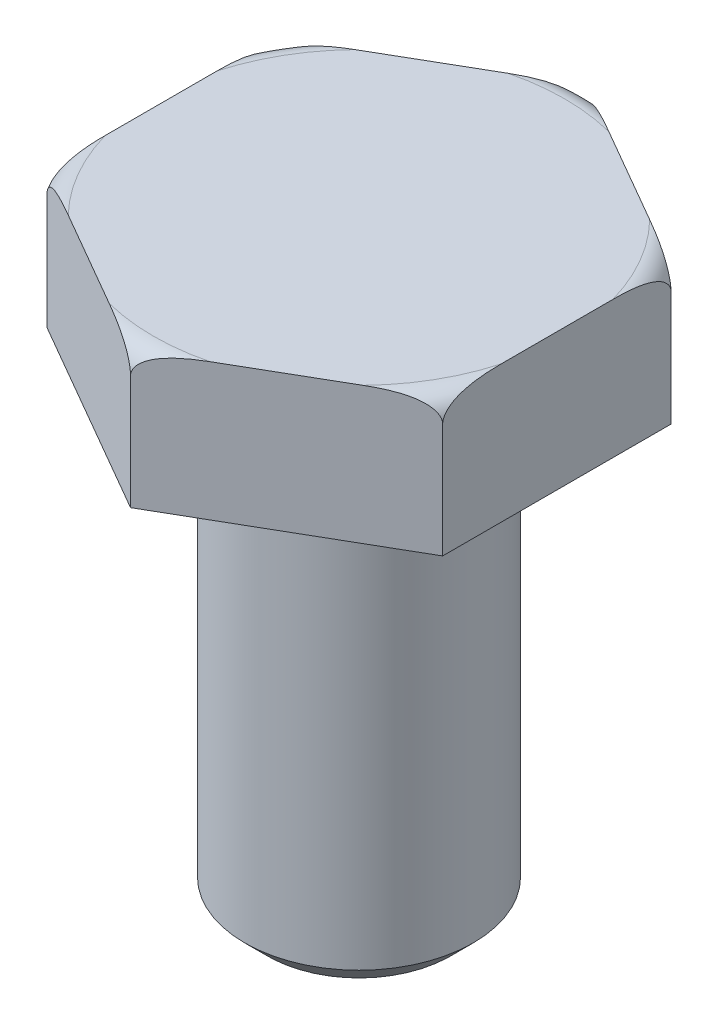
ISO-10303-21;
HEADER;
FILE_DESCRIPTION(('STEP AP214'),'2;1');
FILE_NAME('part.step','',(''),(''),'','','');
FILE_SCHEMA(('AUTOMOTIVE_DESIGN { 1 0 10303 214 1 1 1 1 }'));
ENDSEC;
DATA;
#1=APPLICATION_CONTEXT('core data for automotive mechanical design processes');
#2=APPLICATION_PROTOCOL_DEFINITION('international standard','automotive_design',2000,#1);
#3=PRODUCT_CONTEXT('',#1,'mechanical');
#4=PRODUCT('Part','Part','',(#3));
#5=PRODUCT_RELATED_PRODUCT_CATEGORY('part','',(#4));
#6=PRODUCT_DEFINITION_FORMATION('','',#4);
#7=PRODUCT_DEFINITION_CONTEXT('part definition',#1,'design');
#8=PRODUCT_DEFINITION('design','',#6,#7);
#9=PRODUCT_DEFINITION_SHAPE('','',#8);
#10=(LENGTH_UNIT() NAMED_UNIT(*) SI_UNIT(.MILLI.,.METRE.));
#11=(NAMED_UNIT(*) PLANE_ANGLE_UNIT() SI_UNIT($,.RADIAN.));
#12=(NAMED_UNIT(*) SI_UNIT($,.STERADIAN.) SOLID_ANGLE_UNIT());
#13=UNCERTAINTY_MEASURE_WITH_UNIT(LENGTH_MEASURE(1.E-05),#10,'distance_accuracy_value','');
#14=(GEOMETRIC_REPRESENTATION_CONTEXT(3) GLOBAL_UNCERTAINTY_ASSIGNED_CONTEXT((#13)) GLOBAL_UNIT_ASSIGNED_CONTEXT((#10,
#11,#12)) REPRESENTATION_CONTEXT('',''));
#15=CARTESIAN_POINT('',(0.,0.,0.));
#16=DIRECTION('',(0.,0.,1.));
#17=DIRECTION('',(1.,0.,0.));
#18=AXIS2_PLACEMENT_3D('',#15,#16,#17);
#19=CARTESIAN_POINT('',(0.,0.,0.));
#20=DIRECTION('',(0.,1.,0.));
#21=DIRECTION('',(0.,0.,1.));
#22=AXIS2_PLACEMENT_3D('',#19,#20,#21);
#23=PLANE('',#22);
#24=DIRECTION('',(0.,0.,-1.));
#25=VECTOR('',#24,1.);
#26=CARTESIAN_POINT('',(-8.66125498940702,0.,4.99826590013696));
#27=LINE('',#26,#25);
#28=CARTESIAN_POINT('',(-8.66125498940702,0.,4.99826590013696));
#29=VERTEX_POINT('',#28);
#30=CARTESIAN_POINT('',(-8.66125498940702,0.,-4.99826590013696));
#31=VERTEX_POINT('',#30);
#32=EDGE_CURVE('E149',#29,#31,#27,.T.);
#33=ORIENTED_EDGE('',*,*,#32,.T.);
#34=DIRECTION('',(0.865975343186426,0.,-0.500086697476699));
#35=VECTOR('',#34,1.);
#36=CARTESIAN_POINT('',(-8.66125498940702,0.,-4.99826590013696));
#37=LINE('',#36,#35);
#38=CARTESIAN_POINT('',(0.,0.,-10.));
#39=VERTEX_POINT('',#38);
#40=EDGE_CURVE('E49',#31,#39,#37,.T.);
#41=ORIENTED_EDGE('',*,*,#40,.T.);
#42=DIRECTION('',(0.865975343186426,0.,0.5000866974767));
#43=VECTOR('',#42,1.);
#44=CARTESIAN_POINT('',(0.,0.,-10.));
#45=LINE('',#44,#43);
#46=CARTESIAN_POINT('',(8.66125498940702,0.,-4.99826590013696));
#47=VERTEX_POINT('',#46);
#48=EDGE_CURVE('E136',#39,#47,#45,.T.);
#49=ORIENTED_EDGE('',*,*,#48,.T.);
#50=DIRECTION('',(0.,0.,1.));
#51=VECTOR('',#50,1.);
#52=CARTESIAN_POINT('',(8.66125498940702,0.,-4.99826590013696));
#53=LINE('',#52,#51);
#54=CARTESIAN_POINT('',(8.66125498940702,0.,4.99826590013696));
#55=VERTEX_POINT('',#54);
#56=EDGE_CURVE('E143',#47,#55,#53,.T.);
#57=ORIENTED_EDGE('',*,*,#56,.T.);
#58=DIRECTION('',(-0.865975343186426,0.,0.5000866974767));
#59=VECTOR('',#58,1.);
#60=CARTESIAN_POINT('',(8.66125498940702,0.,4.99826590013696));
#61=LINE('',#60,#59);
#62=CARTESIAN_POINT('',(0.,0.,10.));
#63=VERTEX_POINT('',#62);
#64=EDGE_CURVE('E157',#55,#63,#61,.T.);
#65=ORIENTED_EDGE('',*,*,#64,.T.);
#66=DIRECTION('',(-0.865975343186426,0.,-0.5000866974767));
#67=VECTOR('',#66,1.);
#68=CARTESIAN_POINT('',(0.,0.,10.));
#69=LINE('',#68,#67);
#70=EDGE_CURVE('E160',#63,#29,#69,.T.);
#71=ORIENTED_EDGE('',*,*,#70,.T.);
#72=EDGE_LOOP('',(#33,#41,#49,#57,#65,#71));
#73=FACE_BOUND('',#72,.T.);
#74=CARTESIAN_POINT('',(0.,0.,0.));
#75=DIRECTION('',(0.,-1.,0.));
#76=DIRECTION('',(0.,0.,-1.));
#77=AXIS2_PLACEMENT_3D('',#74,#75,#76);
#78=CIRCLE('',#77,5.);
#79=CARTESIAN_POINT('',(0.,0.,-5.));
#80=VERTEX_POINT('',#79);
#81=EDGE_CURVE('E383',#80,#80,#78,.T.);
#82=ORIENTED_EDGE('',*,*,#81,.F.);
#83=EDGE_LOOP('',(#82));
#84=FACE_BOUND('',#83,.T.);
#85=ADVANCED_FACE('F34',(#73,#84),#23,.F.);
#86=CARTESIAN_POINT('',(-8.66125498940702,0.,-4.99826590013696));
#87=DIRECTION('',(0.500086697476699,0.,0.865975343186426));
#88=DIRECTION('',(0.865975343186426,0.,-0.500086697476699));
#89=AXIS2_PLACEMENT_3D('',#86,#87,#88);
#90=PLANE('',#89);
#91=DIRECTION('',(0.,1.,0.));
#92=VECTOR('',#91,1.);
#93=CARTESIAN_POINT('',(-8.66125498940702,0.,-4.99826590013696));
#94=LINE('',#93,#92);
#95=CARTESIAN_POINT('',(-8.66125498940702,5.,-4.99826590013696));
#96=VERTEX_POINT('',#95);
#97=EDGE_CURVE('E163',#31,#96,#94,.T.);
#98=ORIENTED_EDGE('',*,*,#97,.T.);
#99=CARTESIAN_POINT('',(-8.66125495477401,4.9998,-4.99826592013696));
#100=CARTESIAN_POINT('',(-8.66132767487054,5.02984159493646,-4.99822392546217));
#101=CARTESIAN_POINT('',(-8.658935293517,5.05980593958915,-4.99960548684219));
#102=CARTESIAN_POINT('',(-8.64976449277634,5.11857132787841,-5.00490147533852));
#103=CARTESIAN_POINT('',(-8.64302409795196,5.14738017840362,-5.00879394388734));
#104=CARTESIAN_POINT('',(-8.62571065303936,5.20328738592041,-5.01879217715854));
#105=CARTESIAN_POINT('',(-8.61514897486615,5.23039054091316,-5.02489137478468));
#106=CARTESIAN_POINT('',(-8.59087101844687,5.2826816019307,-5.03891150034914));
#107=CARTESIAN_POINT('',(-8.57714786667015,5.30786517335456,-5.04683639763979));
#108=CARTESIAN_POINT('',(-8.53697610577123,5.37263967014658,-5.07003493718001));
#109=CARTESIAN_POINT('',(-8.50823516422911,5.410331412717,-5.0866323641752));
#110=CARTESIAN_POINT('',(-8.44608184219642,5.4801943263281,-5.12252489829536));
#111=CARTESIAN_POINT('',(-8.41265467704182,5.51234727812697,-5.1418285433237));
#112=CARTESIAN_POINT('',(-8.34710425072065,5.56807311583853,-5.17968285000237));
#113=CARTESIAN_POINT('',(-8.31533757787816,5.59221590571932,-5.19802758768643));
#114=CARTESIAN_POINT('',(-8.25011429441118,5.63727083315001,-5.23569297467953));
#115=CARTESIAN_POINT('',(-8.21665635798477,5.65818038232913,-5.25501438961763));
#116=CARTESIAN_POINT('',(-8.14853584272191,5.6971805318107,-5.29435288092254));
#117=CARTESIAN_POINT('',(-8.11387305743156,5.71527064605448,-5.31437007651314));
#118=CARTESIAN_POINT('',(-8.04367992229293,5.74898595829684,-5.35490547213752));
#119=CARTESIAN_POINT('',(-8.00814981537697,5.76461183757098,-5.37542353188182));
#120=CARTESIAN_POINT('',(-7.92461461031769,5.79851268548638,-5.42366375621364));
#121=CARTESIAN_POINT('',(-7.87635901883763,5.81596227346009,-5.45153057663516));
#122=CARTESIAN_POINT('',(-7.77905621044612,5.84764887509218,-5.50772136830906));
#123=CARTESIAN_POINT('',(-7.73000866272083,5.86188450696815,-5.53604553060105));
#124=CARTESIAN_POINT('',(-7.58193189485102,5.90053019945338,-5.62155745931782));
#125=CARTESIAN_POINT('',(-7.48209738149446,5.92083009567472,-5.6792102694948));
#126=CARTESIAN_POINT('',(-7.28063783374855,5.95348239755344,-5.79554988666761));
#127=CARTESIAN_POINT('',(-7.17900477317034,5.96576308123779,-5.85424132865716));
#128=CARTESIAN_POINT('',(-6.97544266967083,5.98419198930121,-5.97179513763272));
#129=CARTESIAN_POINT('',(-6.87351401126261,5.99034617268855,-6.03065728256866));
#130=CARTESIAN_POINT('',(-6.66128339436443,5.99850356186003,-6.15321701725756));
#131=CARTESIAN_POINT('',(-6.55097204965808,6.0001300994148,-6.21692002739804));
#132=CARTESIAN_POINT('',(-6.33034710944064,5.99985403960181,-6.34432734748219));
#133=CARTESIAN_POINT('',(-6.22003351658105,5.9979508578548,-6.40803165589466));
#134=CARTESIAN_POINT('',(-5.99936619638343,5.99204601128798,-6.53546344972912));
#135=CARTESIAN_POINT('',(-5.88901250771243,5.98804266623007,-6.59919091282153));
#136=CARTESIAN_POINT('',(-5.66833006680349,5.97918729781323,-6.72663143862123));
#137=CARTESIAN_POINT('',(-5.55800131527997,5.97433525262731,-6.79034450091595));
#138=CARTESIAN_POINT('',(-5.33715486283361,5.96485325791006,-6.917879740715));
#139=CARTESIAN_POINT('',(-5.22663714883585,5.96022368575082,-6.98170192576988));
#140=CARTESIAN_POINT('',(-5.00556894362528,5.95207877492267,-7.10936522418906));
#141=CARTESIAN_POINT('',(-4.89501845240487,5.94856343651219,-7.17320633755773));
#142=CARTESIAN_POINT('',(-4.67397467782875,5.94327611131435,-7.30085552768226));
#143=CARTESIAN_POINT('',(-4.5634814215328,5.94150270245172,-7.36466358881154));
#144=CARTESIAN_POINT('',(-4.34248500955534,5.94000230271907,-7.49228542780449));
#145=CARTESIAN_POINT('',(-4.2319818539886,5.94027529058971,-7.55609920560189));
#146=CARTESIAN_POINT('',(-4.01187549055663,5.94281003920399,-7.68320705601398));
#147=CARTESIAN_POINT('',(-3.902272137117,5.94505591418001,-7.74650121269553));
#148=CARTESIAN_POINT('',(-3.68309763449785,5.95112910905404,-7.87307092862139));
#149=CARTESIAN_POINT('',(-3.57352648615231,5.95495646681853,-7.93634648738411));
#150=CARTESIAN_POINT('',(-3.35428472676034,5.96351893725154,-8.06295504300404));
#151=CARTESIAN_POINT('',(-3.24461414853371,5.96825510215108,-8.12628802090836));
#152=CARTESIAN_POINT('',(-3.02527553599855,5.97771730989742,-8.25295250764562));
#153=CARTESIAN_POINT('',(-2.91560750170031,5.98244335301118,-8.31628401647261));
#154=CARTESIAN_POINT('',(-2.69656287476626,5.99077308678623,-8.44277873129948));
#155=CARTESIAN_POINT('',(-2.58718638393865,5.9943800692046,-8.50594187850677));
#156=CARTESIAN_POINT('',(-2.36839589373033,5.99923478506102,-8.63228983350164));
#157=CARTESIAN_POINT('',(-2.25898189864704,6.00048273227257,-8.69547463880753));
#158=CARTESIAN_POINT('',(-2.04032083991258,5.99917307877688,-8.82174784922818));
#159=CARTESIAN_POINT('',(-1.93107376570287,5.99662102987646,-8.88483626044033));
#160=CARTESIAN_POINT('',(-1.71278903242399,5.9860197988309,-9.01089214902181));
#161=CARTESIAN_POINT('',(-1.60375130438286,5.97797293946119,-9.07385966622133));
#162=CARTESIAN_POINT('',(-1.45175653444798,5.96138017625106,-9.16163417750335));
#163=CARTESIAN_POINT('',(-1.40853378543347,5.95605077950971,-9.18659461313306));
#164=CARTESIAN_POINT('',(-1.32221618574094,5.94400862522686,-9.23644162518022));
#165=CARTESIAN_POINT('',(-1.27912138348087,5.93729539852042,-9.26132817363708));
#166=CARTESIAN_POINT('',(-1.19304276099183,5.92228589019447,-9.31103718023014));
#167=CARTESIAN_POINT('',(-1.15005937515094,5.9139862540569,-9.33585938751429));
#168=CARTESIAN_POINT('',(-1.06438254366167,5.89559717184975,-9.38533636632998));
#169=CARTESIAN_POINT('',(-1.02168907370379,5.88550787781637,-9.40999115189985));
#170=CARTESIAN_POINT('',(-0.928646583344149,5.86118253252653,-9.46372167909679));
#171=CARTESIAN_POINT('',(-0.878379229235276,5.84652300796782,-9.49275025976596));
#172=CARTESIAN_POINT('',(-0.778682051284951,5.81380811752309,-9.55032376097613));
#173=CARTESIAN_POINT('',(-0.729252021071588,5.79575360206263,-9.57886880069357));
#174=CARTESIAN_POINT('',(-0.631775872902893,5.7556717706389,-9.63515969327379));
#175=CARTESIAN_POINT('',(-0.583725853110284,5.73365727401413,-9.66290779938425));
#176=CARTESIAN_POINT('',(-0.489511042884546,5.68483963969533,-9.71731532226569));
#177=CARTESIAN_POINT('',(-0.443344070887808,5.65804224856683,-9.74397599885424));
#178=CARTESIAN_POINT('',(-0.364373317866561,5.60561068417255,-9.7895803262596));
#179=CARTESIAN_POINT('',(-0.330975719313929,5.58117886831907,-9.80886689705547));
#180=CARTESIAN_POINT('',(-0.266539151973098,5.52833480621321,-9.84607796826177));
#181=CARTESIAN_POINT('',(-0.235502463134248,5.49991878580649,-9.86400115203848));
#182=CARTESIAN_POINT('',(-0.176594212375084,5.43823048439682,-9.89801971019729));
#183=CARTESIAN_POINT('',(-0.148761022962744,5.40490844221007,-9.91409292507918));
#184=CARTESIAN_POINT('',(-0.0984144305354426,5.33324342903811,-9.94316726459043));
#185=CARTESIAN_POINT('',(-0.0758871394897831,5.2949139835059,-9.95617640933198));
#186=CARTESIAN_POINT('',(-0.0447532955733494,5.22720645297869,-9.97415569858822));
#187=CARTESIAN_POINT('',(-0.0340120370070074,5.19913990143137,-9.98035860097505));
#188=CARTESIAN_POINT('',(-0.0166642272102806,5.14137303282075,-9.99037667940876));
#189=CARTESIAN_POINT('',(-0.0100472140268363,5.11167705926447,-9.99419789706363));
#190=CARTESIAN_POINT('',(-0.00385545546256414,5.06805882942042,-9.99777353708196));
#191=CARTESIAN_POINT('',(-0.00240944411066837,5.05446715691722,-9.99860858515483));
#192=CARTESIAN_POINT('',(-0.000478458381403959,5.0271860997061,-9.99972369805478));
#193=CARTESIAN_POINT('',(6.01104845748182E-06,5.01349666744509,-10.0000034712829));
#194=CARTESIAN_POINT('',(-3.46313346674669E-08,4.99980000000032,-9.99999998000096));
#195=B_SPLINE_CURVE_WITH_KNOTS('',3,(#99,#100,#101,#102,#103,#104,#105,#106,#107,#108,#109,#110,
#111,#112,#113,#114,#115,#116,#117,#118,#119,#120,#121,#122,#123,#124,#125,#126,#127,#128,#129,
#130,#131,#132,#133,#134,#135,#136,#137,#138,#139,#140,#141,#142,#143,#144,#145,#146,#147,#148,
#149,#150,#151,#152,#153,#154,#155,#156,#157,#158,#159,#160,#161,#162,#163,#164,#165,#166,#167,
#168,#169,#170,#171,#172,#173,#174,#175,#176,#177,#178,#179,#180,#181,#182,#183,#184,#185,#186,
#187,#188,#189,#190,#191,#192,#193,#194),.UNSPECIFIED.,.F.,.F.,(4,2,2,2,2,2,2,2,2,2,2,2,2,2,2,2,
2,2,2,2,2,2,2,2,2,2,2,2,2,2,2,2,2,2,2,2,2,2,2,2,2,2,2,2,2,2,2,4),(0.,0.0898724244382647,
0.178969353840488,0.267803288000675,0.35683221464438,0.50663023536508,0.656911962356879,
0.788466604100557,0.920126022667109,1.05180811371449,1.18345373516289,1.35850669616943,
1.53363477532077,1.88435859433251,2.23817773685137,2.59165239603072,2.97376272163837,
3.35593631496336,3.73841613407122,4.12090579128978,4.50402286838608,4.88714003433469,
5.2699441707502,5.65274433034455,6.03249013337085,6.41224502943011,6.79244229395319,
7.17262940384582,7.55168733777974,7.93071092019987,8.30918129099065,8.68749177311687,
8.83806423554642,8.98868783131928,9.13963352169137,9.290566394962,9.47008793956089,
9.64956457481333,9.82847033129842,10.0071625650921,10.1439273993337,10.2808226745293,
10.4192167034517,10.5572443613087,10.6489609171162,10.7404438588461,10.7814863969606,
10.8225504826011),.UNSPECIFIED.);
#196=CARTESIAN_POINT('',(-6.45335731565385,6.,-6.27329095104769));
#197=VERTEX_POINT('',#196);
#198=EDGE_CURVE('E226',#96,#197,#195,.T.);
#199=ORIENTED_EDGE('',*,*,#198,.T.);
#200=DIRECTION('',(0.865975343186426,0.,-0.500086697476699));
#201=VECTOR('',#200,1.);
#202=CARTESIAN_POINT('',(-8.66125498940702,6.,-4.99826590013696));
#203=LINE('',#202,#201);
#204=CARTESIAN_POINT('',(-2.20789767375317,6.,-8.72497494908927));
#205=VERTEX_POINT('',#204);
#206=EDGE_CURVE('E389',#197,#205,#203,.T.);
#207=ORIENTED_EDGE('',*,*,#206,.T.);
#208=CARTESIAN_POINT('',(0.,5.,-10.));
#209=VERTEX_POINT('',#208);
#210=EDGE_CURVE('E129',#205,#209,#195,.T.);
#211=ORIENTED_EDGE('',*,*,#210,.T.);
#212=DIRECTION('',(0.,1.,0.));
#213=VECTOR('',#212,1.);
#214=CARTESIAN_POINT('',(0.,0.,-10.));
#215=LINE('',#214,#213);
#216=EDGE_CURVE('E125',#39,#209,#215,.T.);
#217=ORIENTED_EDGE('',*,*,#216,.F.);
#218=ORIENTED_EDGE('',*,*,#40,.F.);
#219=EDGE_LOOP('',(#98,#199,#207,#211,#217,#218));
#220=FACE_BOUND('',#219,.T.);
#221=ADVANCED_FACE('F127',(#220),#90,.F.);
#222=CARTESIAN_POINT('',(0.,0.,-10.));
#223=DIRECTION('',(-0.5000866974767,0.,0.865975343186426));
#224=DIRECTION('',(0.865975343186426,0.,0.5000866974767));
#225=AXIS2_PLACEMENT_3D('',#222,#223,#224);
#226=PLANE('',#225);
#227=ORIENTED_EDGE('',*,*,#216,.T.);
#228=CARTESIAN_POINT('',(3.46330104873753E-08,4.9998,-9.99999998));
#229=CARTESIAN_POINT('',(-7.2685463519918E-05,5.02984159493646,-10.0000419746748));
#230=CARTESIAN_POINT('',(0.00231969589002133,5.05980593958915,-9.99866041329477));
#231=CARTESIAN_POINT('',(0.0114904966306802,5.11857132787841,-9.99336442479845));
#232=CARTESIAN_POINT('',(0.0182308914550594,5.14738017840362,-9.98947195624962));
#233=CARTESIAN_POINT('',(0.0355443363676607,5.20328738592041,-9.97947372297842));
#234=CARTESIAN_POINT('',(0.0461060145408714,5.23039054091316,-9.97337452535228));
#235=CARTESIAN_POINT('',(0.0703839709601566,5.2826816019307,-9.95935439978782));
#236=CARTESIAN_POINT('',(0.0841071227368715,5.30786517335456,-9.95142950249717));
#237=CARTESIAN_POINT('',(0.124278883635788,5.37263967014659,-9.92823096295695));
#238=CARTESIAN_POINT('',(0.153019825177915,5.410331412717,-9.91163353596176));
#239=CARTESIAN_POINT('',(0.215173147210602,5.4801943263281,-9.8757410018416));
#240=CARTESIAN_POINT('',(0.248600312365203,5.51234727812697,-9.85643735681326));
#241=CARTESIAN_POINT('',(0.314150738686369,5.56807311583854,-9.81858305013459));
#242=CARTESIAN_POINT('',(0.345917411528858,5.59221590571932,-9.80023831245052));
#243=CARTESIAN_POINT('',(0.411140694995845,5.63727083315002,-9.76257292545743));
#244=CARTESIAN_POINT('',(0.444598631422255,5.65818038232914,-9.74325151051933));
#245=CARTESIAN_POINT('',(0.512719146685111,5.69718053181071,-9.70391301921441));
#246=CARTESIAN_POINT('',(0.547381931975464,5.71527064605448,-9.68389582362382));
#247=CARTESIAN_POINT('',(0.617575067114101,5.74898595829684,-9.64336042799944));
#248=CARTESIAN_POINT('',(0.653105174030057,5.76461183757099,-9.62284236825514));
#249=CARTESIAN_POINT('',(0.736640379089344,5.79851268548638,-9.57460214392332));
#250=CARTESIAN_POINT('',(0.784895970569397,5.81596227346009,-9.54673532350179));
#251=CARTESIAN_POINT('',(0.882198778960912,5.84764887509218,-9.49054453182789));
#252=CARTESIAN_POINT('',(0.931246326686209,5.86188450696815,-9.4622203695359));
#253=CARTESIAN_POINT('',(1.07932309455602,5.90053019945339,-9.37670844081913));
#254=CARTESIAN_POINT('',(1.17915760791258,5.92083009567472,-9.31905563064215));
#255=CARTESIAN_POINT('',(1.3806171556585,5.95348239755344,-9.20271601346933));
#256=CARTESIAN_POINT('',(1.48225021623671,5.96576308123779,-9.14402457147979));
#257=CARTESIAN_POINT('',(1.68581231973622,5.98419198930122,-9.02647076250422));
#258=CARTESIAN_POINT('',(1.78774097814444,5.99034617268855,-8.96760861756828));
#259=CARTESIAN_POINT('',(1.99997159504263,5.99850356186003,-8.84504888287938));
#260=CARTESIAN_POINT('',(2.11028293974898,6.0001300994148,-8.78134587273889));
#261=CARTESIAN_POINT('',(2.33090787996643,5.99985403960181,-8.65393855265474));
#262=CARTESIAN_POINT('',(2.44122147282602,5.9979508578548,-8.59023424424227));
#263=CARTESIAN_POINT('',(2.66188879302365,5.99204601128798,-8.4628024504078));
#264=CARTESIAN_POINT('',(2.77224248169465,5.98804266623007,-8.39907498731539));
#265=CARTESIAN_POINT('',(2.9929249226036,5.97918729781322,-8.27163446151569));
#266=CARTESIAN_POINT('',(3.10325367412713,5.97433525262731,-8.20792139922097));
#267=CARTESIAN_POINT('',(3.32410012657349,5.96485325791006,-8.08038615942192));
#268=CARTESIAN_POINT('',(3.43461784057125,5.96022368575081,-8.01656397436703));
#269=CARTESIAN_POINT('',(3.65568604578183,5.95207877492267,-7.88890067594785));
#270=CARTESIAN_POINT('',(3.76623653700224,5.94856343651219,-7.82505956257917));
#271=CARTESIAN_POINT('',(3.98728031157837,5.94327611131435,-7.69741037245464));
#272=CARTESIAN_POINT('',(4.09777356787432,5.94150270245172,-7.63360231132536));
#273=CARTESIAN_POINT('',(4.31876997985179,5.94000230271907,-7.5059804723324));
#274=CARTESIAN_POINT('',(4.42927313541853,5.94027529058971,-7.442166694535));
#275=CARTESIAN_POINT('',(4.6493794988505,5.94281003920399,-7.31505884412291));
#276=CARTESIAN_POINT('',(4.75898285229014,5.94505591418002,-7.25176468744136));
#277=CARTESIAN_POINT('',(4.97815735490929,5.95112910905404,-7.1251949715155));
#278=CARTESIAN_POINT('',(5.08772850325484,5.95495646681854,-7.06191941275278));
#279=CARTESIAN_POINT('',(5.30697026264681,5.96351893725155,-6.93531085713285));
#280=CARTESIAN_POINT('',(5.41664084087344,5.96825510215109,-6.87197787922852));
#281=CARTESIAN_POINT('',(5.63597945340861,5.97771730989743,-6.74531339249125));
#282=CARTESIAN_POINT('',(5.74564748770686,5.98244335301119,-6.68198188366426));
#283=CARTESIAN_POINT('',(5.96469211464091,5.99077308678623,-6.55548716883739));
#284=CARTESIAN_POINT('',(6.07406860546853,5.99438006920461,-6.4923240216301));
#285=CARTESIAN_POINT('',(6.29285909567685,5.99923478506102,-6.36597606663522));
#286=CARTESIAN_POINT('',(6.40227309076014,6.00048273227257,-6.30279126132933));
#287=CARTESIAN_POINT('',(6.62093414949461,5.99917307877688,-6.17651805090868));
#288=CARTESIAN_POINT('',(6.73018122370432,5.99662102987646,-6.11342963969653));
#289=CARTESIAN_POINT('',(6.94846595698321,5.98601979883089,-5.98737375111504));
#290=CARTESIAN_POINT('',(7.05750368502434,5.97797293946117,-5.92440623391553));
#291=CARTESIAN_POINT('',(7.20949845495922,5.96138017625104,-5.83663172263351));
#292=CARTESIAN_POINT('',(7.25272120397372,5.95605077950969,-5.81167128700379));
#293=CARTESIAN_POINT('',(7.33903880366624,5.94400862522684,-5.76182427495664));
#294=CARTESIAN_POINT('',(7.3821336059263,5.9372953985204,-5.73693772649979));
#295=CARTESIAN_POINT('',(7.46821222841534,5.92228589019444,-5.68722871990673));
#296=CARTESIAN_POINT('',(7.51119561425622,5.91398625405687,-5.66240651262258));
#297=CARTESIAN_POINT('',(7.59687244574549,5.89559717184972,-5.6129295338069));
#298=CARTESIAN_POINT('',(7.63956591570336,5.88550787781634,-5.58827474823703));
#299=CARTESIAN_POINT('',(7.73260840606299,5.8611825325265,-5.5345442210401));
#300=CARTESIAN_POINT('',(7.78287576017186,5.84652300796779,-5.50551564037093));
#301=CARTESIAN_POINT('',(7.88257293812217,5.81380811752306,-5.44794213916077));
#302=CARTESIAN_POINT('',(7.93200296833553,5.79575360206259,-5.41939709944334));
#303=CARTESIAN_POINT('',(8.02947911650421,5.75567177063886,-5.36310620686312));
#304=CARTESIAN_POINT('',(8.07752913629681,5.73365727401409,-5.33535810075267));
#305=CARTESIAN_POINT('',(8.17174394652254,5.68483963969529,-5.28095057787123));
#306=CARTESIAN_POINT('',(8.21791091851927,5.6580422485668,-5.25428990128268));
#307=CARTESIAN_POINT('',(8.29688167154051,5.60561068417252,-5.20868557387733));
#308=CARTESIAN_POINT('',(8.33027927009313,5.58117886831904,-5.18939900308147));
#309=CARTESIAN_POINT('',(8.39471583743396,5.52833480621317,-5.15218793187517));
#310=CARTESIAN_POINT('',(8.42575252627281,5.49991878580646,-5.13426474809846));
#311=CARTESIAN_POINT('',(8.48466077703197,5.43823048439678,-5.10024618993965));
#312=CARTESIAN_POINT('',(8.51249396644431,5.40490844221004,-5.08417297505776));
#313=CARTESIAN_POINT('',(8.5628405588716,5.33324342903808,-5.05509863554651));
#314=CARTESIAN_POINT('',(8.58536784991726,5.29491398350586,-5.04208949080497));
#315=CARTESIAN_POINT('',(8.61650169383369,5.22720645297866,-5.02411020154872));
#316=CARTESIAN_POINT('',(8.62724295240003,5.19913990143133,-5.0179072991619));
#317=CARTESIAN_POINT('',(8.64459076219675,5.14137303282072,-5.00788922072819));
#318=CARTESIAN_POINT('',(8.65120777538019,5.11167705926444,-5.00406800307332));
#319=CARTESIAN_POINT('',(8.65739953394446,5.06805882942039,-5.000492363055));
#320=CARTESIAN_POINT('',(8.65884554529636,5.05446715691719,-4.99965731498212));
#321=CARTESIAN_POINT('',(8.66077653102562,5.02718609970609,-4.99854220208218));
#322=CARTESIAN_POINT('',(8.66126100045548,5.01349666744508,-4.99826242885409));
#323=CARTESIAN_POINT('',(8.66125495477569,4.99980000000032,-4.99826592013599));
#324=B_SPLINE_CURVE_WITH_KNOTS('',3,(#228,#229,#230,#231,#232,#233,#234,#235,#236,#237,#238,
#239,#240,#241,#242,#243,#244,#245,#246,#247,#248,#249,#250,#251,#252,#253,#254,#255,#256,#257,
#258,#259,#260,#261,#262,#263,#264,#265,#266,#267,#268,#269,#270,#271,#272,#273,#274,#275,#276,
#277,#278,#279,#280,#281,#282,#283,#284,#285,#286,#287,#288,#289,#290,#291,#292,#293,#294,#295,
#296,#297,#298,#299,#300,#301,#302,#303,#304,#305,#306,#307,#308,#309,#310,#311,#312,#313,#314,
#315,#316,#317,#318,#319,#320,#321,#322,#323),.UNSPECIFIED.,.F.,.F.,(4,2,2,2,2,2,2,2,2,2,2,2,2,
2,2,2,2,2,2,2,2,2,2,2,2,2,2,2,2,2,2,2,2,2,2,2,2,2,2,2,2,2,2,2,2,2,2,4),(0.,0.0898724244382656,
0.17896935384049,0.267803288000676,0.356832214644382,0.506630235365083,0.656911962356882,
0.78846660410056,0.920126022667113,1.0518081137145,1.1834537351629,1.35850669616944,
1.53363477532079,1.88435859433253,2.23817773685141,2.59165239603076,2.97376272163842,
3.35593631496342,3.73841613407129,4.12090579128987,4.50402286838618,4.8871400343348,
5.26994417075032,5.65274433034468,6.03249013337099,6.41224502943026,6.79244229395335,
7.17262940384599,7.55168733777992,7.93071092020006,8.30918129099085,8.68749177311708,
8.83806423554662,8.98868783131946,9.13963352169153,9.29056639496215,9.47008793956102,
9.64956457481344,9.82847033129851,10.0071625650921,10.1439273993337,10.2808226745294,
10.4192167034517,10.5572443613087,10.6489609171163,10.7404438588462,10.7814863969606,
10.8225504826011),.UNSPECIFIED.);
#325=CARTESIAN_POINT('',(2.20789767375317,6.,-8.72497494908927));
#326=VERTEX_POINT('',#325);
#327=EDGE_CURVE('E243',#209,#326,#324,.T.);
#328=ORIENTED_EDGE('',*,*,#327,.T.);
#329=DIRECTION('',(0.865975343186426,0.,0.5000866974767));
#330=VECTOR('',#329,1.);
#331=CARTESIAN_POINT('',(0.,6.,-10.));
#332=LINE('',#331,#330);
#333=CARTESIAN_POINT('',(6.45335731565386,6.,-6.27329095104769));
#334=VERTEX_POINT('',#333);
#335=EDGE_CURVE('E391',#326,#334,#332,.T.);
#336=ORIENTED_EDGE('',*,*,#335,.T.);
#337=CARTESIAN_POINT('',(8.66125498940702,5.,-4.99826590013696));
#338=VERTEX_POINT('',#337);
#339=EDGE_CURVE('E238',#334,#338,#324,.T.);
#340=ORIENTED_EDGE('',*,*,#339,.T.);
#341=DIRECTION('',(0.,1.,0.));
#342=VECTOR('',#341,1.);
#343=CARTESIAN_POINT('',(8.66125498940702,0.,-4.99826590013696));
#344=LINE('',#343,#342);
#345=EDGE_CURVE('E133',#47,#338,#344,.T.);
#346=ORIENTED_EDGE('',*,*,#345,.F.);
#347=ORIENTED_EDGE('',*,*,#48,.F.);
#348=EDGE_LOOP('',(#227,#328,#336,#340,#346,#347));
#349=FACE_BOUND('',#348,.T.);
#350=ADVANCED_FACE('F137',(#349),#226,.F.);
#351=CARTESIAN_POINT('',(8.66125498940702,0.,-4.99826590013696));
#352=DIRECTION('',(-1.,0.,0.));
#353=DIRECTION('',(0.,0.,1.));
#354=AXIS2_PLACEMENT_3D('',#351,#352,#353);
#355=PLANE('',#354);
#356=DIRECTION('',(0.,0.,1.));
#357=VECTOR('',#356,1.);
#358=CARTESIAN_POINT('',(8.66125498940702,6.,-4.99826590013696));
#359=LINE('',#358,#357);
#360=CARTESIAN_POINT('',(8.66125498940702,6.,-2.44594807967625));
#361=VERTEX_POINT('',#360);
#362=CARTESIAN_POINT('',(8.66125498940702,6.,2.44594807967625));
#363=VERTEX_POINT('',#362);
#364=EDGE_CURVE('E394',#361,#363,#359,.T.);
#365=ORIENTED_EDGE('',*,*,#364,.T.);
#366=CARTESIAN_POINT('',(8.66125498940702,5.94087821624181,0.));
#367=CARTESIAN_POINT('',(8.66125498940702,5.94087657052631,0.166599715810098));
#368=CARTESIAN_POINT('',(8.66125498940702,5.94265195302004,0.33319948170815));
#369=CARTESIAN_POINT('',(8.66125498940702,5.94923443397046,0.666542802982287));
#370=CARTESIAN_POINT('',(8.66125498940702,5.95404534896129,0.833286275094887));
#371=CARTESIAN_POINT('',(8.66125498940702,5.965254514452,1.1668936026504));
#372=CARTESIAN_POINT('',(8.66125498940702,5.97165447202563,1.33375739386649));
#373=CARTESIAN_POINT('',(8.66125498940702,5.98387503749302,1.66754398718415));
#374=CARTESIAN_POINT('',(8.66125498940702,5.98969552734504,1.83446679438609));
#375=CARTESIAN_POINT('',(8.66125498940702,5.9980433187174,2.16793288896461));
#376=CARTESIAN_POINT('',(8.66125498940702,6.00057996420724,2.33447590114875));
#377=CARTESIAN_POINT('',(8.66125498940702,5.99919152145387,2.66751646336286));
#378=CARTESIAN_POINT('',(8.66125498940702,5.99526953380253,2.83401399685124));
#379=CARTESIAN_POINT('',(8.66125498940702,5.97939026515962,3.12175376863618));
#380=CARTESIAN_POINT('',(8.66125498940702,5.96987815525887,3.24312228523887));
#381=CARTESIAN_POINT('',(8.66125498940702,5.9431107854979,3.48570820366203));
#382=CARTESIAN_POINT('',(8.66125498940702,5.92581599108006,3.60692162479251));
#383=CARTESIAN_POINT('',(8.66125498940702,5.88870365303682,3.80447863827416));
#384=CARTESIAN_POINT('',(8.66125498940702,5.8719886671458,3.881398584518));
#385=CARTESIAN_POINT('',(8.66125498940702,5.83312031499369,4.03397963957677));
#386=CARTESIAN_POINT('',(8.66125498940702,5.81096101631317,4.1096392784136));
#387=CARTESIAN_POINT('',(8.66125498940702,5.76004823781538,4.25816779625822));
#388=CARTESIAN_POINT('',(8.66125498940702,5.73134123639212,4.33105230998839));
#389=CARTESIAN_POINT('',(8.66125498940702,5.66551167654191,4.47284124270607));
#390=CARTESIAN_POINT('',(8.66125498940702,5.62841336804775,4.54175642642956));
#391=CARTESIAN_POINT('',(8.66125498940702,5.55585132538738,4.65345435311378));
#392=CARTESIAN_POINT('',(8.66125498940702,5.5230957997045,4.69797598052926));
#393=CARTESIAN_POINT('',(8.66125498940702,5.4511828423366,4.78151646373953));
#394=CARTESIAN_POINT('',(8.66125498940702,5.4120452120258,4.8205516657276));
#395=CARTESIAN_POINT('',(8.66125498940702,5.34261934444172,4.87697673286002));
#396=CARTESIAN_POINT('',(8.66125498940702,5.3144883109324,4.89700465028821));
#397=CARTESIAN_POINT('',(8.66125498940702,5.25546674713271,4.93255594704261));
#398=CARTESIAN_POINT('',(8.66125498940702,5.22457726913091,4.94808103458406));
#399=CARTESIAN_POINT('',(8.66125498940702,5.16009561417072,4.9735300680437));
#400=CARTESIAN_POINT('',(8.66125498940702,5.12647592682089,4.9833860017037));
#401=CARTESIAN_POINT('',(8.66125498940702,5.05794549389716,4.99608703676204));
#402=CARTESIAN_POINT('',(8.66125498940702,5.02303678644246,4.99894276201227));
#403=CARTESIAN_POINT('',(8.66125498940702,4.95876613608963,4.99743703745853));
#404=CARTESIAN_POINT('',(8.66125498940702,4.92937496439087,4.99411573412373));
#405=CARTESIAN_POINT('',(8.66125498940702,4.87158407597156,4.98253639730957));
#406=CARTESIAN_POINT('',(8.66125498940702,4.84318493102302,4.97427556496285));
#407=CARTESIAN_POINT('',(8.66125498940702,4.78150527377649,4.95100348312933));
#408=CARTESIAN_POINT('',(8.66125498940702,4.74865592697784,4.93485874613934));
#409=CARTESIAN_POINT('',(8.66125498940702,4.68601324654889,4.89747496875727));
#410=CARTESIAN_POINT('',(8.66125498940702,4.65622528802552,4.87622717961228));
#411=CARTESIAN_POINT('',(8.66125498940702,4.58546160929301,4.81821592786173));
#412=CARTESIAN_POINT('',(8.66125498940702,4.54647308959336,4.77904851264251));
#413=CARTESIAN_POINT('',(8.66125498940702,4.47484582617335,4.69531228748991));
#414=CARTESIAN_POINT('',(8.66125498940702,4.4422233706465,4.65073008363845));
#415=CARTESIAN_POINT('',(8.66125498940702,4.38504508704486,4.56224131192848));
#416=CARTESIAN_POINT('',(8.66125498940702,4.36003036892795,4.51862571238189));
#417=CARTESIAN_POINT('',(8.66125498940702,4.31380295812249,4.42940267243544));
#418=CARTESIAN_POINT('',(8.66125498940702,4.29259357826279,4.38379353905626));
#419=CARTESIAN_POINT('',(8.66125498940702,4.25341346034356,4.29115417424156));
#420=CARTESIAN_POINT('',(8.66125498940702,4.2354467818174,4.24412224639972));
#421=CARTESIAN_POINT('',(8.66125498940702,4.20233041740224,4.14910773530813));
#422=CARTESIAN_POINT('',(8.66125498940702,4.18717970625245,4.10112550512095));
#423=CARTESIAN_POINT('',(8.66125498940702,4.15282708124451,3.98201172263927));
#424=CARTESIAN_POINT('',(8.66125498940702,4.13501280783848,3.91048104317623));
#425=CARTESIAN_POINT('',(8.66125498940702,4.10363062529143,3.76648062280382));
#426=CARTESIAN_POINT('',(8.66125498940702,4.09006491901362,3.69401041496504));
#427=CARTESIAN_POINT('',(8.66125498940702,4.06643043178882,3.54838117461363));
#428=CARTESIAN_POINT('',(8.66125498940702,4.05636779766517,3.47522116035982));
#429=CARTESIAN_POINT('',(8.66125498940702,4.03917364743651,3.32855246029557));
#430=CARTESIAN_POINT('',(8.66125498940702,4.03204268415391,3.25504371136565));
#431=CARTESIAN_POINT('',(8.66125498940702,4.01420637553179,3.03328915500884));
#432=CARTESIAN_POINT('',(8.66125498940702,4.00719511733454,2.88474911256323));
#433=CARTESIAN_POINT('',(8.66125498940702,3.99973683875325,2.58770335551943));
#434=CARTESIAN_POINT('',(8.66125498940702,3.99928374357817,2.43919773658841));
#435=CARTESIAN_POINT('',(8.66125498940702,4.00259190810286,2.12325880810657));
#436=CARTESIAN_POINT('',(8.66125498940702,4.00689945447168,1.95583334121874));
#437=CARTESIAN_POINT('',(8.66125498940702,4.01759520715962,1.62104062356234));
#438=CARTESIAN_POINT('',(8.66125498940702,4.02398369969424,1.45367338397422));
#439=CARTESIAN_POINT('',(8.66125498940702,4.03634061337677,1.11891931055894));
#440=CARTESIAN_POINT('',(8.66125498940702,4.04230903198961,0.951532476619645));
#441=CARTESIAN_POINT('',(8.66125498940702,4.0519158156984,0.616703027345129));
#442=CARTESIAN_POINT('',(8.66125498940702,4.05555443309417,0.449260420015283));
#443=CARTESIAN_POINT('',(8.66125498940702,4.05940990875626,0.114713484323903));
#444=CARTESIAN_POINT('',(8.66125498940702,4.05963455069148,-0.0523907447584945));
#445=CARTESIAN_POINT('',(8.66125498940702,4.05661618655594,-0.386572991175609));
#446=CARTESIAN_POINT('',(8.66125498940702,4.05337300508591,-0.553651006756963));
#447=CARTESIAN_POINT('',(8.66125498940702,4.04438024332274,-0.887772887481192));
#448=CARTESIAN_POINT('',(8.66125498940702,4.03863005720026,-1.0548167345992));
#449=CARTESIAN_POINT('',(8.66125498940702,4.02643035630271,-1.38887402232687));
#450=CARTESIAN_POINT('',(8.66125498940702,4.01998084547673,-1.55588746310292));
#451=CARTESIAN_POINT('',(8.66125498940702,4.00876544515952,-1.89104490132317));
#452=CARTESIAN_POINT('',(8.66125498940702,4.00401051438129,-2.0591893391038));
#453=CARTESIAN_POINT('',(8.66125498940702,3.99923157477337,-2.39565457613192));
#454=CARTESIAN_POINT('',(8.66125498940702,3.99921004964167,-2.56397542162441));
#455=CARTESIAN_POINT('',(8.66125498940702,4.00751387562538,-2.90013431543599));
#456=CARTESIAN_POINT('',(8.66125498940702,4.01582050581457,-3.06797259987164));
#457=CARTESIAN_POINT('',(8.66125498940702,4.03808606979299,-3.3187791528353));
#458=CARTESIAN_POINT('',(8.66125498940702,4.04713436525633,-3.4021762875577));
#459=CARTESIAN_POINT('',(8.66125498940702,4.06928498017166,-3.56842122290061));
#460=CARTESIAN_POINT('',(8.66125498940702,4.0823858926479,-3.65126920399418));
#461=CARTESIAN_POINT('',(8.66125498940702,4.10970714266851,-3.79545594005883));
#462=CARTESIAN_POINT('',(8.66125498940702,4.12283149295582,-3.85700094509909));
#463=CARTESIAN_POINT('',(8.66125498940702,4.15242773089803,-3.97932001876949));
#464=CARTESIAN_POINT('',(8.66125498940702,4.16890094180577,-4.04009377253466));
#465=CARTESIAN_POINT('',(8.66125498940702,4.2057604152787,-4.16021912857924));
#466=CARTESIAN_POINT('',(8.66125498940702,4.22613233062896,-4.21957507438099));
#467=CARTESIAN_POINT('',(8.66125498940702,4.27160964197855,-4.33642051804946));
#468=CARTESIAN_POINT('',(8.66125498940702,4.29671047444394,-4.3939117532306));
#469=CARTESIAN_POINT('',(8.66125498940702,4.34770378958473,-4.4960786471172));
#470=CARTESIAN_POINT('',(8.66125498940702,4.3726622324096,-4.5412156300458));
#471=CARTESIAN_POINT('',(8.66125498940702,4.4272480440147,-4.62873584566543));
#472=CARTESIAN_POINT('',(8.66125498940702,4.45688313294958,-4.67111435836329));
#473=CARTESIAN_POINT('',(8.66125498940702,4.52200514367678,-4.75209067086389));
#474=CARTESIAN_POINT('',(8.66125498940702,4.55756146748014,-4.79063375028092));
#475=CARTESIAN_POINT('',(8.66125498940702,4.63497247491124,-4.86077965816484));
#476=CARTESIAN_POINT('',(8.66125498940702,4.67680131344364,-4.89240971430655));
#477=CARTESIAN_POINT('',(8.66125498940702,4.74845875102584,-4.93444914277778));
#478=CARTESIAN_POINT('',(8.66125498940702,4.77628405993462,-4.94826428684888));
#479=CARTESIAN_POINT('',(8.66125498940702,4.83379941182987,-4.97126412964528));
#480=CARTESIAN_POINT('',(8.66125498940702,4.86348769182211,-4.98045313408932));
#481=CARTESIAN_POINT('',(8.66125498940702,4.92425985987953,-4.99346230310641));
#482=CARTESIAN_POINT('',(8.66125498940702,4.95535203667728,-4.99724458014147));
#483=CARTESIAN_POINT('',(8.66125498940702,5.01769603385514,-4.99892387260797));
#484=CARTESIAN_POINT('',(8.66125498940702,5.04894782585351,-4.99682190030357));
#485=CARTESIAN_POINT('',(8.66125498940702,5.10775564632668,-4.98740669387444));
#486=CARTESIAN_POINT('',(8.66125498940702,5.13539184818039,-4.98057747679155));
#487=CARTESIAN_POINT('',(8.66125498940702,5.18928044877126,-4.96277170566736));
#488=CARTESIAN_POINT('',(8.66125498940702,5.21553223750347,-4.95179334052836));
#489=CARTESIAN_POINT('',(8.66125498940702,5.27724114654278,-4.92087138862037));
#490=CARTESIAN_POINT('',(8.66125498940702,5.31178154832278,-4.89910343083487));
#491=CARTESIAN_POINT('',(8.66125498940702,5.3769696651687,-4.85036685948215));
#492=CARTESIAN_POINT('',(8.66125498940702,5.40760759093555,-4.82338557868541));
#493=CARTESIAN_POINT('',(8.66125498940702,5.48242567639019,-4.74847080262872));
#494=CARTESIAN_POINT('',(8.66125498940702,5.52371383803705,-4.69767318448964));
#495=CARTESIAN_POINT('',(8.66125498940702,5.59836424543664,-4.59062168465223));
#496=CARTESIAN_POINT('',(8.66125498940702,5.63170766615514,-4.5343552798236));
#497=CARTESIAN_POINT('',(8.66125498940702,5.69095661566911,-4.42041699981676));
#498=CARTESIAN_POINT('',(8.66125498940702,5.7170693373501,-4.36285088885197));
#499=CARTESIAN_POINT('',(8.66125498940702,5.7643584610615,-4.24569736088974));
#500=CARTESIAN_POINT('',(8.66125498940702,5.78552989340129,-4.18610797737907));
#501=CARTESIAN_POINT('',(8.66125498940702,5.8237941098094,-4.06552893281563));
#502=CARTESIAN_POINT('',(8.66125498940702,5.84087910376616,-4.00453683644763));
#503=CARTESIAN_POINT('',(8.66125498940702,5.87157534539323,-3.88173634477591));
#504=CARTESIAN_POINT('',(8.66125498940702,5.8851885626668,-3.81992843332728));
#505=CARTESIAN_POINT('',(8.66125498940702,5.91898431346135,-3.64732119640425));
#506=CARTESIAN_POINT('',(8.66125498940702,5.936010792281,-3.53590551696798));
#507=CARTESIAN_POINT('',(8.66125498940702,5.96315712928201,-3.31221346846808));
#508=CARTESIAN_POINT('',(8.66125498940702,5.97327182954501,-3.19993651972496));
#509=CARTESIAN_POINT('',(8.66125498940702,5.98831124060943,-2.97477637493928));
#510=CARTESIAN_POINT('',(8.66125498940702,5.9932231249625,-2.86189236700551));
#511=CARTESIAN_POINT('',(8.66125498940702,5.99918856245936,-2.63601430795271));
#512=CARTESIAN_POINT('',(8.66125498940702,6.00024133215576,-2.52302023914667));
#513=CARTESIAN_POINT('',(8.66125498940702,5.9993738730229,-2.18308223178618));
#514=CARTESIAN_POINT('',(8.66125498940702,5.99338355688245,-1.9561670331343));
#515=CARTESIAN_POINT('',(8.66125498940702,5.97827142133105,-1.50278432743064));
#516=CARTESIAN_POINT('',(8.66125498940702,5.96915363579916,-1.27631661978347));
#517=CARTESIAN_POINT('',(8.66125498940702,5.95530468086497,-0.874712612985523));
#518=CARTESIAN_POINT('',(8.66125498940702,5.95004755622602,-0.699598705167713));
#519=CARTESIAN_POINT('',(8.66125498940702,5.94283857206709,-0.349656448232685));
#520=CARTESIAN_POINT('',(8.66125498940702,5.94087994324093,-0.17482825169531));
#521=CARTESIAN_POINT('',(8.66125498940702,5.94087821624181,0.));
#522=B_SPLINE_CURVE_WITH_KNOTS('',3,(#366,#367,#368,#369,#370,#371,#372,#373,#374,#375,#376,
#377,#378,#379,#380,#381,#382,#383,#384,#385,#386,#387,#388,#389,#390,#391,#392,#393,#394,#395,
#396,#397,#398,#399,#400,#401,#402,#403,#404,#405,#406,#407,#408,#409,#410,#411,#412,#413,#414,
#415,#416,#417,#418,#419,#420,#421,#422,#423,#424,#425,#426,#427,#428,#429,#430,#431,#432,#433,
#434,#435,#436,#437,#438,#439,#440,#441,#442,#443,#444,#445,#446,#447,#448,#449,#450,#451,#452,
#453,#454,#455,#456,#457,#458,#459,#460,#461,#462,#463,#464,#465,#466,#467,#468,#469,#470,#471,
#472,#473,#474,#475,#476,#477,#478,#479,#480,#481,#482,#483,#484,#485,#486,#487,#488,#489,#490,
#491,#492,#493,#494,#495,#496,#497,#498,#499,#500,#501,#502,#503,#504,#505,#506,#507,#508,#509,
#510,#511,#512,#513,#514,#515,#516,#517,#518,#519,#520,#521),.UNSPECIFIED.,.T.,.F.,(4,2,2,2,2,2,
2,2,2,2,2,2,2,2,2,2,2,2,2,2,2,2,2,2,2,2,2,2,2,2,2,2,2,2,2,2,2,2,2,2,2,2,2,2,2,2,2,2,2,2,2,2,2,2,
2,2,2,2,2,2,2,2,2,2,2,2,2,2,2,2,2,2,2,2,2,2,2,4),(0.,0.499791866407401,1.00021336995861,
1.50117480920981,2.00223808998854,2.50187247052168,3.00126706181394,3.36633050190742,
3.73326970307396,3.9692675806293,4.20552376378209,4.44015239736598,4.67411145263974,
4.83949390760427,5.00437267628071,5.10764768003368,5.21088345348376,5.3153332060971,
5.41962434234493,5.50791341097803,5.59625255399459,5.70545474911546,5.81484551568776,
5.97971138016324,6.14499369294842,6.29561230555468,6.44636141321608,6.59729795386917,
6.74817943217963,6.96915292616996,7.19024080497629,7.41171469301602,7.63323032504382,
8.07908755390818,8.52453176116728,9.0269337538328,9.52940487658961,10.0318790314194,
10.5342987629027,11.035572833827,11.5368722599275,12.0382928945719,12.539710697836,
13.0443146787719,13.5491834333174,14.0529198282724,14.3045055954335,14.5560041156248,
14.7447158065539,14.9335022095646,15.1216067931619,15.309530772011,15.4640462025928,
15.6188194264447,15.775554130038,15.9316599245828,16.0245256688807,16.1173048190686,
16.2107309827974,16.3041410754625,16.3891780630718,16.4742522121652,16.5960417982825,
16.7181311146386,16.9134092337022,17.1091455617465,17.2984951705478,17.4880344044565,
17.6779321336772,17.867721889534,18.2055197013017,18.5435693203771,18.8824504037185,
19.2214002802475,19.9022526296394,20.5822300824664,21.1077870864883,21.632264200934),.UNSPECIFIED.);
#523=CARTESIAN_POINT('',(8.66125498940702,5.,4.99826590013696));
#524=VERTEX_POINT('',#523);
#525=EDGE_CURVE('E231',#363,#524,#522,.T.);
#526=ORIENTED_EDGE('',*,*,#525,.T.);
#527=DIRECTION('',(0.,1.,0.));
#528=VECTOR('',#527,1.);
#529=CARTESIAN_POINT('',(8.66125498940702,0.,4.99826590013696));
#530=LINE('',#529,#528);
#531=EDGE_CURVE('E171',#55,#524,#530,.T.);
#532=ORIENTED_EDGE('',*,*,#531,.F.);
#533=ORIENTED_EDGE('',*,*,#56,.F.);
#534=ORIENTED_EDGE('',*,*,#345,.T.);
#535=EDGE_CURVE('E237',#338,#361,#522,.T.);
#536=ORIENTED_EDGE('',*,*,#535,.T.);
#537=EDGE_LOOP('',(#365,#526,#532,#533,#534,#536));
#538=FACE_BOUND('',#537,.T.);
#539=ADVANCED_FACE('F213',(#538),#355,.F.);
#540=CARTESIAN_POINT('',(8.66125498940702,0.,4.99826590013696));
#541=DIRECTION('',(-0.5000866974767,0.,-0.865975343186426));
#542=DIRECTION('',(-0.865975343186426,0.,0.5000866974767));
#543=AXIS2_PLACEMENT_3D('',#540,#541,#542);
#544=PLANE('',#543);
#545=ORIENTED_EDGE('',*,*,#531,.T.);
#546=CARTESIAN_POINT('',(8.66125495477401,4.9998,4.99826592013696));
#547=CARTESIAN_POINT('',(8.66132767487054,5.02984159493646,4.99822392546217));
#548=CARTESIAN_POINT('',(8.658935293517,5.05980593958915,4.99960548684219));
#549=CARTESIAN_POINT('',(8.64976449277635,5.11857132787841,5.00490147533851));
#550=CARTESIAN_POINT('',(8.64302409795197,5.14738017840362,5.00879394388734));
#551=CARTESIAN_POINT('',(8.62571065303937,5.20328738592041,5.01879217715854));
#552=CARTESIAN_POINT('',(8.61514897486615,5.23039054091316,5.02489137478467));
#553=CARTESIAN_POINT('',(8.59087101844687,5.2826816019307,5.03891150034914));
#554=CARTESIAN_POINT('',(8.57714786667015,5.30786517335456,5.04683639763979));
#555=CARTESIAN_POINT('',(8.53697610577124,5.37263967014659,5.07003493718));
#556=CARTESIAN_POINT('',(8.50823516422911,5.410331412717,5.0866323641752));
#557=CARTESIAN_POINT('',(8.44608184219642,5.4801943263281,5.12252489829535));
#558=CARTESIAN_POINT('',(8.41265467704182,5.51234727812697,5.1418285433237));
#559=CARTESIAN_POINT('',(8.34710425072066,5.56807311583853,5.17968285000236));
#560=CARTESIAN_POINT('',(8.31533757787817,5.59221590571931,5.19802758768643));
#561=CARTESIAN_POINT('',(8.25011429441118,5.63727083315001,5.23569297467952));
#562=CARTESIAN_POINT('',(8.21665635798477,5.65818038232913,5.25501438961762));
#563=CARTESIAN_POINT('',(8.14853584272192,5.6971805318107,5.29435288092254));
#564=CARTESIAN_POINT('',(8.11387305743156,5.71527064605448,5.31437007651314));
#565=CARTESIAN_POINT('',(8.04367992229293,5.74898595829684,5.35490547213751));
#566=CARTESIAN_POINT('',(8.00814981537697,5.76461183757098,5.37542353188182));
#567=CARTESIAN_POINT('',(7.92461461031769,5.79851268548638,5.42366375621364));
#568=CARTESIAN_POINT('',(7.87635901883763,5.81596227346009,5.45153057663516));
#569=CARTESIAN_POINT('',(7.77905621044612,5.84764887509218,5.50772136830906));
#570=CARTESIAN_POINT('',(7.73000866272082,5.86188450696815,5.53604553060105));
#571=CARTESIAN_POINT('',(7.58193189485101,5.90053019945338,5.62155745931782));
#572=CARTESIAN_POINT('',(7.48209738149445,5.92083009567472,5.6792102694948));
#573=CARTESIAN_POINT('',(7.28063783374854,5.95348239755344,5.79554988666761));
#574=CARTESIAN_POINT('',(7.17900477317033,5.96576308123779,5.85424132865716));
#575=CARTESIAN_POINT('',(6.97544266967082,5.98419198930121,5.97179513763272));
#576=CARTESIAN_POINT('',(6.8735140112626,5.99034617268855,6.03065728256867));
#577=CARTESIAN_POINT('',(6.66128339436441,5.99850356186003,6.15321701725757));
#578=CARTESIAN_POINT('',(6.55097204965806,6.0001300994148,6.21692002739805));
#579=CARTESIAN_POINT('',(6.33034710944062,5.99985403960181,6.3443273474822));
#580=CARTESIAN_POINT('',(6.22003351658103,5.9979508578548,6.40803165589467));
#581=CARTESIAN_POINT('',(5.9993661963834,5.99204601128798,6.53546344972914));
#582=CARTESIAN_POINT('',(5.88901250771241,5.98804266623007,6.59919091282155));
#583=CARTESIAN_POINT('',(5.66833006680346,5.97918729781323,6.72663143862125));
#584=CARTESIAN_POINT('',(5.55800131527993,5.97433525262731,6.79034450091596));
#585=CARTESIAN_POINT('',(5.33715486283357,5.96485325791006,6.91787974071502));
#586=CARTESIAN_POINT('',(5.22663714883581,5.96022368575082,6.9817019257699));
#587=CARTESIAN_POINT('',(5.00556894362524,5.95207877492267,7.10936522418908));
#588=CARTESIAN_POINT('',(4.89501845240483,5.94856343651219,7.17320633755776));
#589=CARTESIAN_POINT('',(4.6739746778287,5.94327611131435,7.30085552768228));
#590=CARTESIAN_POINT('',(4.56348142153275,5.94150270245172,7.36466358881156));
#591=CARTESIAN_POINT('',(4.34248500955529,5.94000230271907,7.49228542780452));
#592=CARTESIAN_POINT('',(4.23198185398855,5.94027529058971,7.55609920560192));
#593=CARTESIAN_POINT('',(4.01187549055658,5.94281003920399,7.68320705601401));
#594=CARTESIAN_POINT('',(3.90227213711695,5.94505591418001,7.74650121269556));
#595=CARTESIAN_POINT('',(3.6830976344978,5.95112910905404,7.87307092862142));
#596=CARTESIAN_POINT('',(3.57352648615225,5.95495646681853,7.93634648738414));
#597=CARTESIAN_POINT('',(3.35428472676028,5.96351893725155,8.06295504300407));
#598=CARTESIAN_POINT('',(3.24461414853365,5.96825510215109,8.1262880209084));
#599=CARTESIAN_POINT('',(3.02527553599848,5.97771730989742,8.25295250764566));
#600=CARTESIAN_POINT('',(2.91560750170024,5.98244335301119,8.31628401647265));
#601=CARTESIAN_POINT('',(2.69656287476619,5.99077308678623,8.44277873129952));
#602=CARTESIAN_POINT('',(2.58718638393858,5.99438006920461,8.50594187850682));
#603=CARTESIAN_POINT('',(2.36839589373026,5.99923478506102,8.63228983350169));
#604=CARTESIAN_POINT('',(2.25898189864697,6.00048273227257,8.69547463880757));
#605=CARTESIAN_POINT('',(2.0403208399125,5.99917307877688,8.82174784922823));
#606=CARTESIAN_POINT('',(1.93107376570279,5.99662102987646,8.88483626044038));
#607=CARTESIAN_POINT('',(1.71278903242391,5.9860197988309,9.01089214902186));
#608=CARTESIAN_POINT('',(1.60375130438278,5.97797293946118,9.07385966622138));
#609=CARTESIAN_POINT('',(1.4517565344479,5.96138017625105,9.16163417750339));
#610=CARTESIAN_POINT('',(1.4085337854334,5.9560507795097,9.18659461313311));
#611=CARTESIAN_POINT('',(1.32221618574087,5.94400862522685,9.23644162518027));
#612=CARTESIAN_POINT('',(1.2791213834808,5.93729539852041,9.26132817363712));
#613=CARTESIAN_POINT('',(1.19304276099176,5.92228589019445,9.31103718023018));
#614=CARTESIAN_POINT('',(1.15005937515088,5.91398625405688,9.33585938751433));
#615=CARTESIAN_POINT('',(1.06438254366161,5.89559717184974,9.38533636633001));
#616=CARTESIAN_POINT('',(1.02168907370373,5.88550787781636,9.40999115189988));
#617=CARTESIAN_POINT('',(0.928646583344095,5.86118253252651,9.46372167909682));
#618=CARTESIAN_POINT('',(0.878379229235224,5.8465230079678,9.49275025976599));
#619=CARTESIAN_POINT('',(0.778682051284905,5.81380811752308,9.55032376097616));
#620=CARTESIAN_POINT('',(0.729252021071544,5.79575360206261,9.57886880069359));
#621=CARTESIAN_POINT('',(0.631775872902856,5.75567177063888,9.63515969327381));
#622=CARTESIAN_POINT('',(0.58372585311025,5.73365727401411,9.66290779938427));
#623=CARTESIAN_POINT('',(0.489511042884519,5.68483963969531,9.71731532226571));
#624=CARTESIAN_POINT('',(0.443344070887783,5.65804224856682,9.74397599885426));
#625=CARTESIAN_POINT('',(0.364373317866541,5.60561068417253,9.78958032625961));
#626=CARTESIAN_POINT('',(0.330975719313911,5.58117886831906,9.80886689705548));
#627=CARTESIAN_POINT('',(0.266539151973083,5.52833480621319,9.84607796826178));
#628=CARTESIAN_POINT('',(0.235502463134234,5.49991878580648,9.86400115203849));
#629=CARTESIAN_POINT('',(0.176594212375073,5.4382304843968,9.89801971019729));
#630=CARTESIAN_POINT('',(0.148761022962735,5.40490844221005,9.91409292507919));
#631=CARTESIAN_POINT('',(0.0984144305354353,5.33324342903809,9.94316726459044));
#632=CARTESIAN_POINT('',(0.0758871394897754,5.29491398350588,9.95617640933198));
#633=CARTESIAN_POINT('',(0.0447532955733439,5.22720645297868,9.97415569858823));
#634=CARTESIAN_POINT('',(0.0340120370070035,5.19913990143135,9.98035860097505));
#635=CARTESIAN_POINT('',(0.0166642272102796,5.14137303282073,9.99037667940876));
#636=CARTESIAN_POINT('',(0.0100472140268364,5.11167705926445,9.99419789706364));
#637=CARTESIAN_POINT('',(0.00385545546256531,5.0680588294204,9.99777353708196));
#638=CARTESIAN_POINT('',(0.00240944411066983,5.05446715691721,9.99860858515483));
#639=CARTESIAN_POINT('',(0.000478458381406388,5.0271860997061,9.99972369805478));
#640=CARTESIAN_POINT('',(-6.01104845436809E-06,5.01349666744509,10.0000034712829));
#641=CARTESIAN_POINT('',(3.46313392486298E-08,4.99980000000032,9.99999998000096));
#642=B_SPLINE_CURVE_WITH_KNOTS('',3,(#546,#547,#548,#549,#550,#551,#552,#553,#554,#555,#556,
#557,#558,#559,#560,#561,#562,#563,#564,#565,#566,#567,#568,#569,#570,#571,#572,#573,#574,#575,
#576,#577,#578,#579,#580,#581,#582,#583,#584,#585,#586,#587,#588,#589,#590,#591,#592,#593,#594,
#595,#596,#597,#598,#599,#600,#601,#602,#603,#604,#605,#606,#607,#608,#609,#610,#611,#612,#613,
#614,#615,#616,#617,#618,#619,#620,#621,#622,#623,#624,#625,#626,#627,#628,#629,#630,#631,#632,
#633,#634,#635,#636,#637,#638,#639,#640,#641),.UNSPECIFIED.,.F.,.F.,(4,2,2,2,2,2,2,2,2,2,2,2,2,
2,2,2,2,2,2,2,2,2,2,2,2,2,2,2,2,2,2,2,2,2,2,2,2,2,2,2,2,2,2,2,2,2,2,4),(0.,0.0898724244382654,
0.178969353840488,0.267803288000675,0.356832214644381,0.50663023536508,0.656911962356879,
0.788466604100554,0.920126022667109,1.05180811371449,1.18345373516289,1.35850669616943,
1.53363477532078,1.88435859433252,2.23817773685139,2.59165239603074,2.9737627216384,
3.35593631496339,3.73841613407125,4.12090579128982,4.50402286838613,4.88714003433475,
5.26994417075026,5.65274433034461,6.03249013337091,6.41224502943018,6.79244229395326,
7.1726294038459,7.55168733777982,7.93071092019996,8.30918129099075,8.68749177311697,
8.83806423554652,8.98868783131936,9.13963352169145,9.29056639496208,9.47008793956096,
9.64956457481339,9.82847033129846,10.0071625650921,10.1439273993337,10.2808226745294,
10.4192167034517,10.5572443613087,10.6489609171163,10.7404438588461,10.7814863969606,
10.8225504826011),.UNSPECIFIED.);
#643=CARTESIAN_POINT('',(6.45335731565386,6.,6.27329095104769));
#644=VERTEX_POINT('',#643);
#645=EDGE_CURVE('E224',#524,#644,#642,.T.);
#646=ORIENTED_EDGE('',*,*,#645,.T.);
#647=DIRECTION('',(-0.865975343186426,0.,0.5000866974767));
#648=VECTOR('',#647,1.);
#649=CARTESIAN_POINT('',(8.66125498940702,6.,4.99826590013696));
#650=LINE('',#649,#648);
#651=CARTESIAN_POINT('',(2.20789767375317,6.,8.72497494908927));
#652=VERTEX_POINT('',#651);
#653=EDGE_CURVE('E397',#644,#652,#650,.T.);
#654=ORIENTED_EDGE('',*,*,#653,.T.);
#655=CARTESIAN_POINT('',(0.,5.,10.));
#656=VERTEX_POINT('',#655);
#657=EDGE_CURVE('E217',#652,#656,#642,.T.);
#658=ORIENTED_EDGE('',*,*,#657,.T.);
#659=DIRECTION('',(0.,1.,0.));
#660=VECTOR('',#659,1.);
#661=CARTESIAN_POINT('',(0.,0.,10.));
#662=LINE('',#661,#660);
#663=EDGE_CURVE('E168',#63,#656,#662,.T.);
#664=ORIENTED_EDGE('',*,*,#663,.F.);
#665=ORIENTED_EDGE('',*,*,#64,.F.);
#666=EDGE_LOOP('',(#545,#646,#654,#658,#664,#665));
#667=FACE_BOUND('',#666,.T.);
#668=ADVANCED_FACE('F208',(#667),#544,.F.);
#669=CARTESIAN_POINT('',(0.,0.,10.));
#670=DIRECTION('',(0.5000866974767,0.,-0.865975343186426));
#671=DIRECTION('',(-0.865975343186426,0.,-0.5000866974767));
#672=AXIS2_PLACEMENT_3D('',#669,#670,#671);
#673=PLANE('',#672);
#674=ORIENTED_EDGE('',*,*,#663,.T.);
#675=CARTESIAN_POINT('',(-3.46330104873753E-08,4.9998,9.99999998));
#676=CARTESIAN_POINT('',(7.2685463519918E-05,5.02984159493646,10.0000419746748));
#677=CARTESIAN_POINT('',(-0.00231969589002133,5.05980593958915,9.99866041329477));
#678=CARTESIAN_POINT('',(-0.0114904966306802,5.11857132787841,9.99336442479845));
#679=CARTESIAN_POINT('',(-0.0182308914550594,5.14738017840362,9.98947195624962));
#680=CARTESIAN_POINT('',(-0.0355443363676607,5.20328738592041,9.97947372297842));
#681=CARTESIAN_POINT('',(-0.0461060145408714,5.23039054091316,9.97337452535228));
#682=CARTESIAN_POINT('',(-0.0703839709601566,5.2826816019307,9.95935439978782));
#683=CARTESIAN_POINT('',(-0.0841071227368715,5.30786517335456,9.95142950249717));
#684=CARTESIAN_POINT('',(-0.124278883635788,5.37263967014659,9.92823096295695));
#685=CARTESIAN_POINT('',(-0.153019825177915,5.410331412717,9.91163353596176));
#686=CARTESIAN_POINT('',(-0.215173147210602,5.4801943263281,9.8757410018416));
#687=CARTESIAN_POINT('',(-0.248600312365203,5.51234727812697,9.85643735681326));
#688=CARTESIAN_POINT('',(-0.314150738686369,5.56807311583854,9.81858305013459));
#689=CARTESIAN_POINT('',(-0.345917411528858,5.59221590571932,9.80023831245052));
#690=CARTESIAN_POINT('',(-0.411140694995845,5.63727083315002,9.76257292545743));
#691=CARTESIAN_POINT('',(-0.444598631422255,5.65818038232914,9.74325151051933));
#692=CARTESIAN_POINT('',(-0.512719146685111,5.69718053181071,9.70391301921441));
#693=CARTESIAN_POINT('',(-0.547381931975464,5.71527064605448,9.68389582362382));
#694=CARTESIAN_POINT('',(-0.617575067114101,5.74898595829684,9.64336042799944));
#695=CARTESIAN_POINT('',(-0.653105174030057,5.76461183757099,9.62284236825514));
#696=CARTESIAN_POINT('',(-0.736640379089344,5.79851268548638,9.57460214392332));
#697=CARTESIAN_POINT('',(-0.784895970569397,5.81596227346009,9.54673532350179));
#698=CARTESIAN_POINT('',(-0.882198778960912,5.84764887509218,9.49054453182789));
#699=CARTESIAN_POINT('',(-0.931246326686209,5.86188450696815,9.4622203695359));
#700=CARTESIAN_POINT('',(-1.07932309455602,5.90053019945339,9.37670844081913));
#701=CARTESIAN_POINT('',(-1.17915760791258,5.92083009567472,9.31905563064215));
#702=CARTESIAN_POINT('',(-1.3806171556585,5.95348239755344,9.20271601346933));
#703=CARTESIAN_POINT('',(-1.48225021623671,5.96576308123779,9.14402457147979));
#704=CARTESIAN_POINT('',(-1.68581231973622,5.98419198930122,9.02647076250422));
#705=CARTESIAN_POINT('',(-1.78774097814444,5.99034617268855,8.96760861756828));
#706=CARTESIAN_POINT('',(-1.99997159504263,5.99850356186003,8.84504888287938));
#707=CARTESIAN_POINT('',(-2.11028293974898,6.0001300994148,8.78134587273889));
#708=CARTESIAN_POINT('',(-2.33090787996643,5.99985403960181,8.65393855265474));
#709=CARTESIAN_POINT('',(-2.44122147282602,5.9979508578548,8.59023424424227));
#710=CARTESIAN_POINT('',(-2.66188879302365,5.99204601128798,8.4628024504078));
#711=CARTESIAN_POINT('',(-2.77224248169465,5.98804266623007,8.39907498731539));
#712=CARTESIAN_POINT('',(-2.9929249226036,5.97918729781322,8.27163446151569));
#713=CARTESIAN_POINT('',(-3.10325367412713,5.97433525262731,8.20792139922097));
#714=CARTESIAN_POINT('',(-3.32410012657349,5.96485325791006,8.08038615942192));
#715=CARTESIAN_POINT('',(-3.43461784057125,5.96022368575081,8.01656397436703));
#716=CARTESIAN_POINT('',(-3.65568604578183,5.95207877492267,7.88890067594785));
#717=CARTESIAN_POINT('',(-3.76623653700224,5.94856343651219,7.82505956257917));
#718=CARTESIAN_POINT('',(-3.98728031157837,5.94327611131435,7.69741037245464));
#719=CARTESIAN_POINT('',(-4.09777356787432,5.94150270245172,7.63360231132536));
#720=CARTESIAN_POINT('',(-4.31876997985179,5.94000230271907,7.5059804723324));
#721=CARTESIAN_POINT('',(-4.42927313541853,5.94027529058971,7.442166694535));
#722=CARTESIAN_POINT('',(-4.6493794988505,5.94281003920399,7.31505884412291));
#723=CARTESIAN_POINT('',(-4.75898285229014,5.94505591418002,7.25176468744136));
#724=CARTESIAN_POINT('',(-4.97815735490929,5.95112910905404,7.1251949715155));
#725=CARTESIAN_POINT('',(-5.08772850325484,5.95495646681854,7.06191941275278));
#726=CARTESIAN_POINT('',(-5.30697026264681,5.96351893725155,6.93531085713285));
#727=CARTESIAN_POINT('',(-5.41664084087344,5.96825510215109,6.87197787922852));
#728=CARTESIAN_POINT('',(-5.63597945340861,5.97771730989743,6.74531339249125));
#729=CARTESIAN_POINT('',(-5.74564748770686,5.98244335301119,6.68198188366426));
#730=CARTESIAN_POINT('',(-5.96469211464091,5.99077308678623,6.55548716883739));
#731=CARTESIAN_POINT('',(-6.07406860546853,5.99438006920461,6.4923240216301));
#732=CARTESIAN_POINT('',(-6.29285909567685,5.99923478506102,6.36597606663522));
#733=CARTESIAN_POINT('',(-6.40227309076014,6.00048273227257,6.30279126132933));
#734=CARTESIAN_POINT('',(-6.62093414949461,5.99917307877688,6.17651805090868));
#735=CARTESIAN_POINT('',(-6.73018122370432,5.99662102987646,6.11342963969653));
#736=CARTESIAN_POINT('',(-6.94846595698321,5.98601979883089,5.98737375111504));
#737=CARTESIAN_POINT('',(-7.05750368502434,5.97797293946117,5.92440623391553));
#738=CARTESIAN_POINT('',(-7.20949845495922,5.96138017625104,5.83663172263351));
#739=CARTESIAN_POINT('',(-7.25272120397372,5.95605077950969,5.81167128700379));
#740=CARTESIAN_POINT('',(-7.33903880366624,5.94400862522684,5.76182427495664));
#741=CARTESIAN_POINT('',(-7.3821336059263,5.9372953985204,5.73693772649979));
#742=CARTESIAN_POINT('',(-7.46821222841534,5.92228589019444,5.68722871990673));
#743=CARTESIAN_POINT('',(-7.51119561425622,5.91398625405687,5.66240651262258));
#744=CARTESIAN_POINT('',(-7.59687244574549,5.89559717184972,5.6129295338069));
#745=CARTESIAN_POINT('',(-7.63956591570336,5.88550787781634,5.58827474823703));
#746=CARTESIAN_POINT('',(-7.73260840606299,5.8611825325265,5.5345442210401));
#747=CARTESIAN_POINT('',(-7.78287576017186,5.84652300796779,5.50551564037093));
#748=CARTESIAN_POINT('',(-7.88257293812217,5.81380811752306,5.44794213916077));
#749=CARTESIAN_POINT('',(-7.93200296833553,5.79575360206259,5.41939709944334));
#750=CARTESIAN_POINT('',(-8.02947911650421,5.75567177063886,5.36310620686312));
#751=CARTESIAN_POINT('',(-8.07752913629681,5.73365727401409,5.33535810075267));
#752=CARTESIAN_POINT('',(-8.17174394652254,5.68483963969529,5.28095057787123));
#753=CARTESIAN_POINT('',(-8.21791091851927,5.6580422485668,5.25428990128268));
#754=CARTESIAN_POINT('',(-8.29688167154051,5.60561068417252,5.20868557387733));
#755=CARTESIAN_POINT('',(-8.33027927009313,5.58117886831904,5.18939900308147));
#756=CARTESIAN_POINT('',(-8.39471583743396,5.52833480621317,5.15218793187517));
#757=CARTESIAN_POINT('',(-8.42575252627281,5.49991878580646,5.13426474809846));
#758=CARTESIAN_POINT('',(-8.48466077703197,5.43823048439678,5.10024618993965));
#759=CARTESIAN_POINT('',(-8.51249396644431,5.40490844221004,5.08417297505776));
#760=CARTESIAN_POINT('',(-8.5628405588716,5.33324342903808,5.05509863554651));
#761=CARTESIAN_POINT('',(-8.58536784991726,5.29491398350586,5.04208949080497));
#762=CARTESIAN_POINT('',(-8.61650169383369,5.22720645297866,5.02411020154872));
#763=CARTESIAN_POINT('',(-8.62724295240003,5.19913990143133,5.0179072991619));
#764=CARTESIAN_POINT('',(-8.64459076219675,5.14137303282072,5.00788922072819));
#765=CARTESIAN_POINT('',(-8.65120777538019,5.11167705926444,5.00406800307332));
#766=CARTESIAN_POINT('',(-8.65739953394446,5.06805882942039,5.000492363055));
#767=CARTESIAN_POINT('',(-8.65884554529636,5.05446715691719,4.99965731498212));
#768=CARTESIAN_POINT('',(-8.66077653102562,5.02718609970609,4.99854220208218));
#769=CARTESIAN_POINT('',(-8.66126100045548,5.01349666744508,4.99826242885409));
#770=CARTESIAN_POINT('',(-8.66125495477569,4.99980000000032,4.99826592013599));
#771=B_SPLINE_CURVE_WITH_KNOTS('',3,(#675,#676,#677,#678,#679,#680,#681,#682,#683,#684,#685,
#686,#687,#688,#689,#690,#691,#692,#693,#694,#695,#696,#697,#698,#699,#700,#701,#702,#703,#704,
#705,#706,#707,#708,#709,#710,#711,#712,#713,#714,#715,#716,#717,#718,#719,#720,#721,#722,#723,
#724,#725,#726,#727,#728,#729,#730,#731,#732,#733,#734,#735,#736,#737,#738,#739,#740,#741,#742,
#743,#744,#745,#746,#747,#748,#749,#750,#751,#752,#753,#754,#755,#756,#757,#758,#759,#760,#761,
#762,#763,#764,#765,#766,#767,#768,#769,#770),.UNSPECIFIED.,.F.,.F.,(4,2,2,2,2,2,2,2,2,2,2,2,2,
2,2,2,2,2,2,2,2,2,2,2,2,2,2,2,2,2,2,2,2,2,2,2,2,2,2,2,2,2,2,2,2,2,2,4),(0.,0.0898724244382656,
0.17896935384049,0.267803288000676,0.356832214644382,0.506630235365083,0.656911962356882,
0.78846660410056,0.920126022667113,1.0518081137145,1.1834537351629,1.35850669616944,
1.53363477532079,1.88435859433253,2.23817773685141,2.59165239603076,2.97376272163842,
3.35593631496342,3.73841613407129,4.12090579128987,4.50402286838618,4.8871400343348,
5.26994417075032,5.65274433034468,6.03249013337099,6.41224502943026,6.79244229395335,
7.17262940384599,7.55168733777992,7.93071092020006,8.30918129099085,8.68749177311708,
8.83806423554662,8.98868783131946,9.13963352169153,9.29056639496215,9.47008793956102,
9.64956457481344,9.82847033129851,10.0071625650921,10.1439273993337,10.2808226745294,
10.4192167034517,10.5572443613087,10.6489609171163,10.7404438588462,10.7814863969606,
10.8225504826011),.UNSPECIFIED.);
#772=CARTESIAN_POINT('',(-2.20789767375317,6.,8.72497494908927));
#773=VERTEX_POINT('',#772);
#774=EDGE_CURVE('E225',#656,#773,#771,.T.);
#775=ORIENTED_EDGE('',*,*,#774,.T.);
#776=DIRECTION('',(-0.865975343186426,0.,-0.5000866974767));
#777=VECTOR('',#776,1.);
#778=CARTESIAN_POINT('',(0.,6.,10.));
#779=LINE('',#778,#777);
#780=CARTESIAN_POINT('',(-6.45335731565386,6.,6.27329095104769));
#781=VERTEX_POINT('',#780);
#782=EDGE_CURVE('E57',#773,#781,#779,.T.);
#783=ORIENTED_EDGE('',*,*,#782,.T.);
#784=CARTESIAN_POINT('',(-8.66125498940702,5.,4.99826590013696));
#785=VERTEX_POINT('',#784);
#786=EDGE_CURVE('E186',#781,#785,#771,.T.);
#787=ORIENTED_EDGE('',*,*,#786,.T.);
#788=DIRECTION('',(0.,1.,0.));
#789=VECTOR('',#788,1.);
#790=CARTESIAN_POINT('',(-8.66125498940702,0.,4.99826590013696));
#791=LINE('',#790,#789);
#792=EDGE_CURVE('E165',#29,#785,#791,.T.);
#793=ORIENTED_EDGE('',*,*,#792,.F.);
#794=ORIENTED_EDGE('',*,*,#70,.F.);
#795=EDGE_LOOP('',(#674,#775,#783,#787,#793,#794));
#796=FACE_BOUND('',#795,.T.);
#797=ADVANCED_FACE('F201',(#796),#673,.F.);
#798=CARTESIAN_POINT('',(-8.66125498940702,0.,4.99826590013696));
#799=DIRECTION('',(1.,0.,0.));
#800=DIRECTION('',(0.,0.,-1.));
#801=AXIS2_PLACEMENT_3D('',#798,#799,#800);
#802=PLANE('',#801);
#803=DIRECTION('',(0.,0.,-1.));
#804=VECTOR('',#803,1.);
#805=CARTESIAN_POINT('',(-8.66125498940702,6.,4.99826590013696));
#806=LINE('',#805,#804);
#807=CARTESIAN_POINT('',(-8.66125498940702,6.,2.44594807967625));
#808=VERTEX_POINT('',#807);
#809=CARTESIAN_POINT('',(-8.66125498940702,6.,-2.44594807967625));
#810=VERTEX_POINT('',#809);
#811=EDGE_CURVE('E150',#808,#810,#806,.T.);
#812=ORIENTED_EDGE('',*,*,#811,.T.);
#813=CARTESIAN_POINT('',(-8.66125498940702,5.94087821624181,0.));
#814=CARTESIAN_POINT('',(-8.66125498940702,5.94087657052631,-0.1665997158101));
#815=CARTESIAN_POINT('',(-8.66125498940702,5.94265195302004,-0.333199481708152));
#816=CARTESIAN_POINT('',(-8.66125498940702,5.94923443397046,-0.666542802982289));
#817=CARTESIAN_POINT('',(-8.66125498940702,5.95404534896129,-0.833286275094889));
#818=CARTESIAN_POINT('',(-8.66125498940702,5.965254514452,-1.16689360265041));
#819=CARTESIAN_POINT('',(-8.66125498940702,5.97165447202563,-1.33375739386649));
#820=CARTESIAN_POINT('',(-8.66125498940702,5.98387503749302,-1.66754398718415));
#821=CARTESIAN_POINT('',(-8.66125498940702,5.98969552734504,-1.83446679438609));
#822=CARTESIAN_POINT('',(-8.66125498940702,5.9980433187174,-2.16793288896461));
#823=CARTESIAN_POINT('',(-8.66125498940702,6.00057996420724,-2.33447590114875));
#824=CARTESIAN_POINT('',(-8.66125498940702,5.99919152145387,-2.66751646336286));
#825=CARTESIAN_POINT('',(-8.66125498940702,5.99526953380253,-2.83401399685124));
#826=CARTESIAN_POINT('',(-8.66125498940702,5.97939026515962,-3.12175376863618));
#827=CARTESIAN_POINT('',(-8.66125498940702,5.96987815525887,-3.24312228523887));
#828=CARTESIAN_POINT('',(-8.66125498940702,5.9431107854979,-3.48570820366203));
#829=CARTESIAN_POINT('',(-8.66125498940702,5.92581599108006,-3.60692162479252));
#830=CARTESIAN_POINT('',(-8.66125498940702,5.88870365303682,-3.80447863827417));
#831=CARTESIAN_POINT('',(-8.66125498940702,5.8719886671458,-3.881398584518));
#832=CARTESIAN_POINT('',(-8.66125498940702,5.83312031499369,-4.03397963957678));
#833=CARTESIAN_POINT('',(-8.66125498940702,5.81096101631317,-4.10963927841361));
#834=CARTESIAN_POINT('',(-8.66125498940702,5.76004823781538,-4.25816779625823));
#835=CARTESIAN_POINT('',(-8.66125498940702,5.73134123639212,-4.3310523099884));
#836=CARTESIAN_POINT('',(-8.66125498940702,5.66551167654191,-4.47284124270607));
#837=CARTESIAN_POINT('',(-8.66125498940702,5.62841336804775,-4.54175642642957));
#838=CARTESIAN_POINT('',(-8.66125498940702,5.55585132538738,-4.65345435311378));
#839=CARTESIAN_POINT('',(-8.66125498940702,5.52309579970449,-4.69797598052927));
#840=CARTESIAN_POINT('',(-8.66125498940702,5.4511828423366,-4.78151646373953));
#841=CARTESIAN_POINT('',(-8.66125498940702,5.4120452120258,-4.8205516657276));
#842=CARTESIAN_POINT('',(-8.66125498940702,5.34261934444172,-4.87697673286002));
#843=CARTESIAN_POINT('',(-8.66125498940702,5.31448831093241,-4.89700465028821));
#844=CARTESIAN_POINT('',(-8.66125498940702,5.25546674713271,-4.93255594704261));
#845=CARTESIAN_POINT('',(-8.66125498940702,5.22457726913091,-4.94808103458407));
#846=CARTESIAN_POINT('',(-8.66125498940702,5.16009561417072,-4.97353006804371));
#847=CARTESIAN_POINT('',(-8.66125498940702,5.12647592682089,-4.98338600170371));
#848=CARTESIAN_POINT('',(-8.66125498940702,5.05794549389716,-4.99608703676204));
#849=CARTESIAN_POINT('',(-8.66125498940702,5.02303678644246,-4.99894276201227));
#850=CARTESIAN_POINT('',(-8.66125498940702,4.95876613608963,-4.99743703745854));
#851=CARTESIAN_POINT('',(-8.66125498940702,4.92937496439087,-4.99411573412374));
#852=CARTESIAN_POINT('',(-8.66125498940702,4.87158407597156,-4.98253639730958));
#853=CARTESIAN_POINT('',(-8.66125498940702,4.84318493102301,-4.97427556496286));
#854=CARTESIAN_POINT('',(-8.66125498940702,4.78150527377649,-4.95100348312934));
#855=CARTESIAN_POINT('',(-8.66125498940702,4.74865592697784,-4.93485874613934));
#856=CARTESIAN_POINT('',(-8.66125498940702,4.68601324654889,-4.89747496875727));
#857=CARTESIAN_POINT('',(-8.66125498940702,4.65622528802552,-4.87622717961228));
#858=CARTESIAN_POINT('',(-8.66125498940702,4.58546160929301,-4.81821592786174));
#859=CARTESIAN_POINT('',(-8.66125498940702,4.54647308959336,-4.77904851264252));
#860=CARTESIAN_POINT('',(-8.66125498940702,4.47484582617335,-4.69531228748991));
#861=CARTESIAN_POINT('',(-8.66125498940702,4.4422233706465,-4.65073008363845));
#862=CARTESIAN_POINT('',(-8.66125498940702,4.38504508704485,-4.56224131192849));
#863=CARTESIAN_POINT('',(-8.66125498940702,4.36003036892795,-4.51862571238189));
#864=CARTESIAN_POINT('',(-8.66125498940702,4.31380295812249,-4.42940267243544));
#865=CARTESIAN_POINT('',(-8.66125498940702,4.29259357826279,-4.38379353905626));
#866=CARTESIAN_POINT('',(-8.66125498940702,4.25341346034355,-4.29115417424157));
#867=CARTESIAN_POINT('',(-8.66125498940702,4.2354467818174,-4.24412224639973));
#868=CARTESIAN_POINT('',(-8.66125498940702,4.20233041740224,-4.14910773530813));
#869=CARTESIAN_POINT('',(-8.66125498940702,4.18717970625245,-4.10112550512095));
#870=CARTESIAN_POINT('',(-8.66125498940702,4.15282708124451,-3.98201172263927));
#871=CARTESIAN_POINT('',(-8.66125498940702,4.13501280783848,-3.91048104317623));
#872=CARTESIAN_POINT('',(-8.66125498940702,4.10363062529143,-3.76648062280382));
#873=CARTESIAN_POINT('',(-8.66125498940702,4.09006491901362,-3.69401041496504));
#874=CARTESIAN_POINT('',(-8.66125498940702,4.06643043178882,-3.54838117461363));
#875=CARTESIAN_POINT('',(-8.66125498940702,4.05636779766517,-3.47522116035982));
#876=CARTESIAN_POINT('',(-8.66125498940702,4.03917364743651,-3.32855246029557));
#877=CARTESIAN_POINT('',(-8.66125498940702,4.03204268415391,-3.25504371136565));
#878=CARTESIAN_POINT('',(-8.66125498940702,4.0142063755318,-3.03328915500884));
#879=CARTESIAN_POINT('',(-8.66125498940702,4.00719511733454,-2.88474911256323));
#880=CARTESIAN_POINT('',(-8.66125498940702,3.99973683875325,-2.58770335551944));
#881=CARTESIAN_POINT('',(-8.66125498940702,3.99928374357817,-2.43919773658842));
#882=CARTESIAN_POINT('',(-8.66125498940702,4.00259190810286,-2.12325880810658));
#883=CARTESIAN_POINT('',(-8.66125498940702,4.00689945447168,-1.95583334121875));
#884=CARTESIAN_POINT('',(-8.66125498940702,4.01759520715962,-1.62104062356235));
#885=CARTESIAN_POINT('',(-8.66125498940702,4.02398369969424,-1.45367338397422));
#886=CARTESIAN_POINT('',(-8.66125498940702,4.03634061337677,-1.11891931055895));
#887=CARTESIAN_POINT('',(-8.66125498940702,4.0423090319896,-0.95153247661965));
#888=CARTESIAN_POINT('',(-8.66125498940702,4.0519158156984,-0.616703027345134));
#889=CARTESIAN_POINT('',(-8.66125498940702,4.05555443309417,-0.449260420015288));
#890=CARTESIAN_POINT('',(-8.66125498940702,4.05940990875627,-0.114713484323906));
#891=CARTESIAN_POINT('',(-8.66125498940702,4.05963455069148,0.0523907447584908));
#892=CARTESIAN_POINT('',(-8.66125498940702,4.05661618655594,0.386572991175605));
#893=CARTESIAN_POINT('',(-8.66125498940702,4.05337300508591,0.553651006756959));
#894=CARTESIAN_POINT('',(-8.66125498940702,4.04438024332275,0.887772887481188));
#895=CARTESIAN_POINT('',(-8.66125498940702,4.03863005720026,1.05481673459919));
#896=CARTESIAN_POINT('',(-8.66125498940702,4.02643035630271,1.38887402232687));
#897=CARTESIAN_POINT('',(-8.66125498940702,4.01998084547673,1.55588746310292));
#898=CARTESIAN_POINT('',(-8.66125498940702,4.00876544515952,1.89104490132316));
#899=CARTESIAN_POINT('',(-8.66125498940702,4.00401051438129,2.0591893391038));
#900=CARTESIAN_POINT('',(-8.66125498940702,3.99923157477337,2.39565457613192));
#901=CARTESIAN_POINT('',(-8.66125498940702,3.99921004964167,2.56397542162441));
#902=CARTESIAN_POINT('',(-8.66125498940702,4.00751387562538,2.90013431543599));
#903=CARTESIAN_POINT('',(-8.66125498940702,4.01582050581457,3.06797259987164));
#904=CARTESIAN_POINT('',(-8.66125498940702,4.03808606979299,3.3187791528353));
#905=CARTESIAN_POINT('',(-8.66125498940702,4.04713436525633,3.4021762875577));
#906=CARTESIAN_POINT('',(-8.66125498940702,4.06928498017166,3.56842122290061));
#907=CARTESIAN_POINT('',(-8.66125498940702,4.0823858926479,3.65126920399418));
#908=CARTESIAN_POINT('',(-8.66125498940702,4.10970714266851,3.79545594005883));
#909=CARTESIAN_POINT('',(-8.66125498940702,4.12283149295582,3.85700094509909));
#910=CARTESIAN_POINT('',(-8.66125498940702,4.15242773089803,3.97932001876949));
#911=CARTESIAN_POINT('',(-8.66125498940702,4.16890094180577,4.04009377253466));
#912=CARTESIAN_POINT('',(-8.66125498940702,4.2057604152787,4.16021912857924));
#913=CARTESIAN_POINT('',(-8.66125498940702,4.22613233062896,4.21957507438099));
#914=CARTESIAN_POINT('',(-8.66125498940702,4.27160964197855,4.33642051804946));
#915=CARTESIAN_POINT('',(-8.66125498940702,4.29671047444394,4.3939117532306));
#916=CARTESIAN_POINT('',(-8.66125498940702,4.34770378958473,4.4960786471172));
#917=CARTESIAN_POINT('',(-8.66125498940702,4.3726622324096,4.5412156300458));
#918=CARTESIAN_POINT('',(-8.66125498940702,4.4272480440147,4.62873584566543));
#919=CARTESIAN_POINT('',(-8.66125498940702,4.45688313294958,4.67111435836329));
#920=CARTESIAN_POINT('',(-8.66125498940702,4.52200514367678,4.75209067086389));
#921=CARTESIAN_POINT('',(-8.66125498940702,4.55756146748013,4.79063375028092));
#922=CARTESIAN_POINT('',(-8.66125498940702,4.63497247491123,4.86077965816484));
#923=CARTESIAN_POINT('',(-8.66125498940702,4.67680131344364,4.89240971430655));
#924=CARTESIAN_POINT('',(-8.66125498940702,4.74845875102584,4.93444914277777));
#925=CARTESIAN_POINT('',(-8.66125498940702,4.77628405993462,4.94826428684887));
#926=CARTESIAN_POINT('',(-8.66125498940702,4.83379941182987,4.97126412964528));
#927=CARTESIAN_POINT('',(-8.66125498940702,4.86348769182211,4.98045313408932));
#928=CARTESIAN_POINT('',(-8.66125498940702,4.92425985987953,4.99346230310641));
#929=CARTESIAN_POINT('',(-8.66125498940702,4.95535203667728,4.99724458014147));
#930=CARTESIAN_POINT('',(-8.66125498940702,5.01769603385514,4.99892387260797));
#931=CARTESIAN_POINT('',(-8.66125498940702,5.04894782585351,4.99682190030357));
#932=CARTESIAN_POINT('',(-8.66125498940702,5.10775564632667,4.98740669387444));
#933=CARTESIAN_POINT('',(-8.66125498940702,5.13539184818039,4.98057747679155));
#934=CARTESIAN_POINT('',(-8.66125498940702,5.18928044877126,4.96277170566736));
#935=CARTESIAN_POINT('',(-8.66125498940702,5.21553223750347,4.95179334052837));
#936=CARTESIAN_POINT('',(-8.66125498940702,5.27724114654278,4.92087138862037));
#937=CARTESIAN_POINT('',(-8.66125498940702,5.31178154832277,4.89910343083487));
#938=CARTESIAN_POINT('',(-8.66125498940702,5.37696966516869,4.85036685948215));
#939=CARTESIAN_POINT('',(-8.66125498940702,5.40760759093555,4.82338557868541));
#940=CARTESIAN_POINT('',(-8.66125498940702,5.48242567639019,4.74847080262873));
#941=CARTESIAN_POINT('',(-8.66125498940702,5.52371383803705,4.69767318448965));
#942=CARTESIAN_POINT('',(-8.66125498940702,5.59836424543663,4.59062168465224));
#943=CARTESIAN_POINT('',(-8.66125498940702,5.63170766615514,4.5343552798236));
#944=CARTESIAN_POINT('',(-8.66125498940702,5.69095661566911,4.42041699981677));
#945=CARTESIAN_POINT('',(-8.66125498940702,5.7170693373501,4.36285088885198));
#946=CARTESIAN_POINT('',(-8.66125498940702,5.7643584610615,4.24569736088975));
#947=CARTESIAN_POINT('',(-8.66125498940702,5.78552989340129,4.18610797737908));
#948=CARTESIAN_POINT('',(-8.66125498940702,5.8237941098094,4.06552893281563));
#949=CARTESIAN_POINT('',(-8.66125498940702,5.84087910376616,4.00453683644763));
#950=CARTESIAN_POINT('',(-8.66125498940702,5.87157534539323,3.88173634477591));
#951=CARTESIAN_POINT('',(-8.66125498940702,5.8851885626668,3.81992843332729));
#952=CARTESIAN_POINT('',(-8.66125498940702,5.91898431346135,3.64732119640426));
#953=CARTESIAN_POINT('',(-8.66125498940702,5.936010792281,3.53590551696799));
#954=CARTESIAN_POINT('',(-8.66125498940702,5.96315712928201,3.3122134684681));
#955=CARTESIAN_POINT('',(-8.66125498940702,5.97327182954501,3.19993651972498));
#956=CARTESIAN_POINT('',(-8.66125498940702,5.98831124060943,2.9747763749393));
#957=CARTESIAN_POINT('',(-8.66125498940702,5.9932231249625,2.86189236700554));
#958=CARTESIAN_POINT('',(-8.66125498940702,5.99918856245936,2.63601430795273));
#959=CARTESIAN_POINT('',(-8.66125498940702,6.00024133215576,2.5230202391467));
#960=CARTESIAN_POINT('',(-8.66125498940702,5.9993738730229,2.18308223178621));
#961=CARTESIAN_POINT('',(-8.66125498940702,5.99338355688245,1.95616703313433));
#962=CARTESIAN_POINT('',(-8.66125498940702,5.97827142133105,1.50278432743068));
#963=CARTESIAN_POINT('',(-8.66125498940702,5.96915363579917,1.27631661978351));
#964=CARTESIAN_POINT('',(-8.66125498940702,5.95530468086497,0.874712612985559));
#965=CARTESIAN_POINT('',(-8.66125498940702,5.95004755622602,0.699598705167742));
#966=CARTESIAN_POINT('',(-8.66125498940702,5.94283857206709,0.349656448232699));
#967=CARTESIAN_POINT('',(-8.66125498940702,5.94087994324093,0.174828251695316));
#968=CARTESIAN_POINT('',(-8.66125498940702,5.94087821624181,0.));
#969=B_SPLINE_CURVE_WITH_KNOTS('',3,(#813,#814,#815,#816,#817,#818,#819,#820,#821,#822,#823,
#824,#825,#826,#827,#828,#829,#830,#831,#832,#833,#834,#835,#836,#837,#838,#839,#840,#841,#842,
#843,#844,#845,#846,#847,#848,#849,#850,#851,#852,#853,#854,#855,#856,#857,#858,#859,#860,#861,
#862,#863,#864,#865,#866,#867,#868,#869,#870,#871,#872,#873,#874,#875,#876,#877,#878,#879,#880,
#881,#882,#883,#884,#885,#886,#887,#888,#889,#890,#891,#892,#893,#894,#895,#896,#897,#898,#899,
#900,#901,#902,#903,#904,#905,#906,#907,#908,#909,#910,#911,#912,#913,#914,#915,#916,#917,#918,
#919,#920,#921,#922,#923,#924,#925,#926,#927,#928,#929,#930,#931,#932,#933,#934,#935,#936,#937,
#938,#939,#940,#941,#942,#943,#944,#945,#946,#947,#948,#949,#950,#951,#952,#953,#954,#955,#956,
#957,#958,#959,#960,#961,#962,#963,#964,#965,#966,#967,#968),.UNSPECIFIED.,.T.,.F.,(4,2,2,2,2,2,
2,2,2,2,2,2,2,2,2,2,2,2,2,2,2,2,2,2,2,2,2,2,2,2,2,2,2,2,2,2,2,2,2,2,2,2,2,2,2,2,2,2,2,2,2,2,2,2,
2,2,2,2,2,2,2,2,2,2,2,2,2,2,2,2,2,2,2,2,2,2,2,4),(0.,0.499791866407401,1.00021336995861,
1.50117480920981,2.00223808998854,2.50187247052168,3.00126706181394,3.36633050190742,
3.73326970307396,3.9692675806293,4.20552376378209,4.44015239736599,4.67411145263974,
4.83949390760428,5.00437267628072,5.10764768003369,5.21088345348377,5.31533320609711,
5.41962434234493,5.50791341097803,5.59625255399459,5.70545474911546,5.81484551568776,
5.97971138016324,6.14499369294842,6.29561230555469,6.44636141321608,6.59729795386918,
6.74817943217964,6.96915292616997,7.1902408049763,7.41171469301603,7.63323032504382,
8.07908755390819,8.52453176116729,9.0269337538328,9.52940487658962,10.0318790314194,
10.5342987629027,11.035572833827,11.5368722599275,12.0382928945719,12.539710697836,
13.0443146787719,13.5491834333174,14.0529198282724,14.3045055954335,14.5560041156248,
14.7447158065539,14.9335022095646,15.1216067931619,15.309530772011,15.4640462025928,
15.6188194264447,15.775554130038,15.9316599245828,16.0245256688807,16.1173048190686,
16.2107309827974,16.3041410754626,16.3891780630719,16.4742522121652,16.5960417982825,
16.7181311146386,16.9134092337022,17.1091455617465,17.2984951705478,17.4880344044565,
17.6779321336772,17.867721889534,18.2055197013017,18.543569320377,18.8824504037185,
19.2214002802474,19.9022526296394,20.5822300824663,21.1077870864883,21.632264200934),.UNSPECIFIED.);
#970=EDGE_CURVE('E187',#810,#96,#969,.T.);
#971=ORIENTED_EDGE('',*,*,#970,.T.);
#972=ORIENTED_EDGE('',*,*,#97,.F.);
#973=ORIENTED_EDGE('',*,*,#32,.F.);
#974=ORIENTED_EDGE('',*,*,#792,.T.);
#975=EDGE_CURVE('E178',#785,#808,#969,.T.);
#976=ORIENTED_EDGE('',*,*,#975,.T.);
#977=EDGE_LOOP('',(#812,#971,#972,#973,#974,#976));
#978=FACE_BOUND('',#977,.T.);
#979=ADVANCED_FACE('F197',(#978),#802,.F.);
#980=CARTESIAN_POINT('',(0.,5.,0.));
#981=DIRECTION('',(0.,1.,0.));
#982=DIRECTION('',(0.,0.,1.));
#983=AXIS2_PLACEMENT_3D('',#980,#981,#982);
#984=TOROIDAL_SURFACE('',#983,9.,1.);
#985=ORIENTED_EDGE('',*,*,#210,.F.);
#986=CARTESIAN_POINT('',(0.,6.,0.));
#987=DIRECTION('',(0.,1.,0.));
#988=DIRECTION('',(0.,0.,1.));
#989=AXIS2_PLACEMENT_3D('',#986,#987,#988);
#990=CIRCLE('',#989,9.);
#991=EDGE_CURVE('E408',#326,#205,#990,.T.);
#992=ORIENTED_EDGE('',*,*,#991,.F.);
#993=ORIENTED_EDGE('',*,*,#327,.F.);
#994=EDGE_LOOP('',(#985,#992,#993));
#995=FACE_BOUND('',#994,.T.);
#996=ADVANCED_FACE('F194',(#995),#984,.T.);
#997=ORIENTED_EDGE('',*,*,#339,.F.);
#998=EDGE_CURVE('E410',#361,#334,#990,.T.);
#999=ORIENTED_EDGE('',*,*,#998,.F.);
#1000=ORIENTED_EDGE('',*,*,#535,.F.);
#1001=EDGE_LOOP('',(#997,#999,#1000));
#1002=FACE_BOUND('',#1001,.T.);
#1003=ADVANCED_FACE('F296',(#1002),#984,.T.);
#1004=ORIENTED_EDGE('',*,*,#525,.F.);
#1005=EDGE_CURVE('E177',#644,#363,#990,.T.);
#1006=ORIENTED_EDGE('',*,*,#1005,.F.);
#1007=ORIENTED_EDGE('',*,*,#645,.F.);
#1008=EDGE_LOOP('',(#1004,#1006,#1007));
#1009=FACE_BOUND('',#1008,.T.);
#1010=ADVANCED_FACE('F306',(#1009),#984,.T.);
#1011=ORIENTED_EDGE('',*,*,#657,.F.);
#1012=EDGE_CURVE('E132',#773,#652,#990,.T.);
#1013=ORIENTED_EDGE('',*,*,#1012,.F.);
#1014=ORIENTED_EDGE('',*,*,#774,.F.);
#1015=EDGE_LOOP('',(#1011,#1013,#1014));
#1016=FACE_BOUND('',#1015,.T.);
#1017=ADVANCED_FACE('F315',(#1016),#984,.T.);
#1018=ORIENTED_EDGE('',*,*,#786,.F.);
#1019=EDGE_CURVE('E176',#808,#781,#990,.T.);
#1020=ORIENTED_EDGE('',*,*,#1019,.F.);
#1021=ORIENTED_EDGE('',*,*,#975,.F.);
#1022=EDGE_LOOP('',(#1018,#1020,#1021));
#1023=FACE_BOUND('',#1022,.T.);
#1024=ADVANCED_FACE('F298',(#1023),#984,.T.);
#1025=ORIENTED_EDGE('',*,*,#198,.F.);
#1026=ORIENTED_EDGE('',*,*,#970,.F.);
#1027=EDGE_CURVE('E407',#197,#810,#990,.T.);
#1028=ORIENTED_EDGE('',*,*,#1027,.F.);
#1029=EDGE_LOOP('',(#1025,#1026,#1028));
#1030=FACE_BOUND('',#1029,.T.);
#1031=ADVANCED_FACE('F325',(#1030),#984,.T.);
#1032=CARTESIAN_POINT('',(0.,6.,0.));
#1033=DIRECTION('',(0.,1.,0.));
#1034=DIRECTION('',(0.,0.,1.));
#1035=AXIS2_PLACEMENT_3D('',#1032,#1033,#1034);
#1036=PLANE('',#1035);
#1037=ORIENTED_EDGE('',*,*,#206,.F.);
#1038=ORIENTED_EDGE('',*,*,#1027,.T.);
#1039=ORIENTED_EDGE('',*,*,#811,.F.);
#1040=ORIENTED_EDGE('',*,*,#1019,.T.);
#1041=ORIENTED_EDGE('',*,*,#782,.F.);
#1042=ORIENTED_EDGE('',*,*,#1012,.T.);
#1043=ORIENTED_EDGE('',*,*,#653,.F.);
#1044=ORIENTED_EDGE('',*,*,#1005,.T.);
#1045=ORIENTED_EDGE('',*,*,#364,.F.);
#1046=ORIENTED_EDGE('',*,*,#998,.T.);
#1047=ORIENTED_EDGE('',*,*,#335,.F.);
#1048=ORIENTED_EDGE('',*,*,#991,.T.);
#1049=EDGE_LOOP('',(#1037,#1038,#1039,#1040,#1041,#1042,#1043,#1044,#1045,#1046,#1047,#1048));
#1050=FACE_BOUND('',#1049,.T.);
#1051=ADVANCED_FACE('F36',(#1050),#1036,.T.);
#1052=CARTESIAN_POINT('',(0.,-20.,0.));
#1053=DIRECTION('',(0.,1.,0.));
#1054=DIRECTION('',(0.,0.,1.));
#1055=AXIS2_PLACEMENT_3D('',#1052,#1053,#1054);
#1056=CYLINDRICAL_SURFACE('',#1055,5.);
#1057=CARTESIAN_POINT('',(0.,-19.,0.));
#1058=DIRECTION('',(0.,-1.,0.));
#1059=DIRECTION('',(0.,0.,-1.));
#1060=AXIS2_PLACEMENT_3D('',#1057,#1058,#1059);
#1061=CIRCLE('',#1060,5.);
#1062=CARTESIAN_POINT('',(0.,-19.,-5.));
#1063=VERTEX_POINT('',#1062);
#1064=EDGE_CURVE('E11',#1063,#1063,#1061,.F.);
#1065=ORIENTED_EDGE('',*,*,#1064,.T.);
#1066=EDGE_LOOP('',(#1065));
#1067=FACE_BOUND('',#1066,.T.);
#1068=ORIENTED_EDGE('',*,*,#81,.T.);
#1069=EDGE_LOOP('',(#1068));
#1070=FACE_BOUND('',#1069,.T.);
#1071=ADVANCED_FACE('F348',(#1067,#1070),#1056,.T.);
#1072=CARTESIAN_POINT('',(0.,-20.,0.));
#1073=DIRECTION('',(0.,-1.,0.));
#1074=DIRECTION('',(0.,0.,-1.));
#1075=AXIS2_PLACEMENT_3D('',#1072,#1073,#1074);
#1076=PLANE('',#1075);
#1077=CARTESIAN_POINT('',(0.,-20.,0.));
#1078=DIRECTION('',(0.,-1.,0.));
#1079=DIRECTION('',(0.,0.,-1.));
#1080=AXIS2_PLACEMENT_3D('',#1077,#1078,#1079);
#1081=CIRCLE('',#1080,3.99999999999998);
#1082=CARTESIAN_POINT('',(0.,-20.,-3.99999999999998));
#1083=VERTEX_POINT('',#1082);
#1084=EDGE_CURVE('E42',#1083,#1083,#1081,.T.);
#1085=ORIENTED_EDGE('',*,*,#1084,.T.);
#1086=EDGE_LOOP('',(#1085));
#1087=FACE_BOUND('',#1086,.T.);
#1088=ADVANCED_FACE('F349',(#1087),#1076,.T.);
#1089=CARTESIAN_POINT('',(0.,-20.,0.));
#1090=DIRECTION('',(0.,1.,0.));
#1091=DIRECTION('',(0.,0.,1.));
#1092=AXIS2_PLACEMENT_3D('',#1089,#1090,#1091);
#1093=CONICAL_SURFACE('',#1092,3.99999999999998,0.785398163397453);
#1094=ORIENTED_EDGE('',*,*,#1064,.F.);
#1095=EDGE_LOOP('',(#1094));
#1096=FACE_BOUND('',#1095,.T.);
#1097=ORIENTED_EDGE('',*,*,#1084,.F.);
#1098=EDGE_LOOP('',(#1097));
#1099=FACE_BOUND('',#1098,.T.);
#1100=ADVANCED_FACE('F358',(#1096,#1099),#1093,.T.);
#1101=CLOSED_SHELL('',(#85,#221,#350,#539,#668,#797,#979,#996,#1003,#1010,#1017,#1024,#1031,
#1051,#1071,#1088,#1100));
#1102=MANIFOLD_SOLID_BREP('B2',#1101);
#1103=ADVANCED_BREP_SHAPE_REPRESENTATION('',(#18,#1102),#14);
#1104=SHAPE_DEFINITION_REPRESENTATION(#9,#1103);
ENDSEC;
END-ISO-10303-21;
